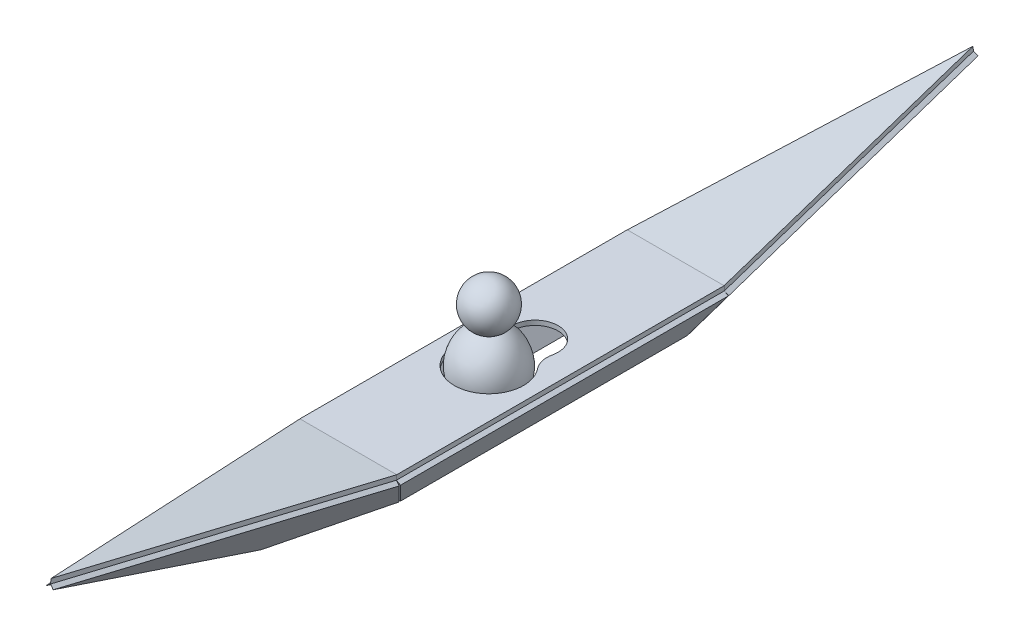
ISO-10303-21;
HEADER;
FILE_DESCRIPTION(('STEP AP214'),'2;1');
FILE_NAME('part.step','',(''),(''),'','','');
FILE_SCHEMA(('AUTOMOTIVE_DESIGN { 1 0 10303 214 1 1 1 1 }'));
ENDSEC;
DATA;
#1=APPLICATION_CONTEXT('core data for automotive mechanical design processes');
#2=APPLICATION_PROTOCOL_DEFINITION('international standard','automotive_design',2000,#1);
#3=PRODUCT_CONTEXT('',#1,'mechanical');
#4=PRODUCT('Part','Part','',(#3));
#5=PRODUCT_RELATED_PRODUCT_CATEGORY('part','',(#4));
#6=PRODUCT_DEFINITION_FORMATION('','',#4);
#7=PRODUCT_DEFINITION_CONTEXT('part definition',#1,'design');
#8=PRODUCT_DEFINITION('design','',#6,#7);
#9=PRODUCT_DEFINITION_SHAPE('','',#8);
#10=(LENGTH_UNIT() NAMED_UNIT(*) SI_UNIT(.MILLI.,.METRE.));
#11=(NAMED_UNIT(*) PLANE_ANGLE_UNIT() SI_UNIT($,.RADIAN.));
#12=(NAMED_UNIT(*) SI_UNIT($,.STERADIAN.) SOLID_ANGLE_UNIT());
#13=UNCERTAINTY_MEASURE_WITH_UNIT(LENGTH_MEASURE(1.E-05),#10,'distance_accuracy_value','');
#14=(GEOMETRIC_REPRESENTATION_CONTEXT(3) GLOBAL_UNCERTAINTY_ASSIGNED_CONTEXT((#13)) GLOBAL_UNIT_ASSIGNED_CONTEXT((#10,
#11,#12)) REPRESENTATION_CONTEXT('',''));
#15=CARTESIAN_POINT('',(0.,0.,0.));
#16=DIRECTION('',(0.,0.,1.));
#17=DIRECTION('',(1.,0.,0.));
#18=AXIS2_PLACEMENT_3D('',#15,#16,#17);
#19=CARTESIAN_POINT('',(0.,16.7332005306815,13.));
#20=DIRECTION('',(-1.,0.,0.));
#21=DIRECTION('',(0.,0.,-1.));
#22=AXIS2_PLACEMENT_3D('',#19,#20,#21);
#23=CIRCLE('',#22,17.);
#24=TRIMMED_CURVE('',#23,(PARAMETER_VALUE(-1.39339672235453)),
(PARAMETER_VALUE(1.39339672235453)),.T.,.PARAMETER.);
#25=CARTESIAN_POINT('',(0.,16.7332005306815,10.));
#26=DIRECTION('',(0.,-1.,0.));
#27=AXIS1_PLACEMENT('',#25,#26);
#28=SURFACE_OF_REVOLUTION('',#24,#27);
#29=CARTESIAN_POINT('',(0.,31.546054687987,10.));
#30=DIRECTION('',(0.,-1.,0.));
#31=DIRECTION('',(0.,0.,-1.));
#32=AXIS2_PLACEMENT_3D('',#29,#30,#31);
#33=CIRCLE('',#32,5.34142384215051);
#34=CARTESIAN_POINT('',(0.,31.546054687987,4.65857615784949));
#35=VERTEX_POINT('',#34);
#36=EDGE_CURVE('E13',#35,#35,#33,.T.);
#37=ORIENTED_EDGE('',*,*,#36,.T.);
#38=EDGE_LOOP('',(#37));
#39=FACE_BOUND('',#38,.T.);
#40=CARTESIAN_POINT('',(0.,0.,10.));
#41=VERTEX_POINT('',#40);
#42=VERTEX_LOOP('',#41);
#43=FACE_BOUND('',#42,.T.);
#44=ADVANCED_FACE('F63',(#39,#43),#28,.T.);
#45=CARTESIAN_POINT('',(0.,40.,10.));
#46=DIRECTION('',(0.,-1.,0.));
#47=DIRECTION('',(0.,0.,-1.));
#48=AXIS2_PLACEMENT_3D('',#45,#46,#47);
#49=SPHERICAL_SURFACE('',#48,10.);
#50=ORIENTED_EDGE('',*,*,#36,.F.);
#51=EDGE_LOOP('',(#50));
#52=FACE_BOUND('',#51,.T.);
#53=ADVANCED_FACE('F71',(#52),#49,.T.);
#54=CLOSED_SHELL('',(#44,#53));
#55=MANIFOLD_SOLID_BREP('B2_NOT_SHOWN',#54);
#56=CARTESIAN_POINT('',(-21.8807202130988,0.,197.522880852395));
#57=DIRECTION('',(-0.570781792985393,-0.80860754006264,-0.142695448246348));
#58=DIRECTION('',(0.242535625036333,0.,-0.970142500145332));
#59=AXIS2_PLACEMENT_3D('',#56,#57,#58);
#60=PLANE('',#59);
#61=DIRECTION('',(0.784464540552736,-0.588348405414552,0.196116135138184));
#62=VECTOR('',#61,1.);
#63=CARTESIAN_POINT('',(0.,0.,110.));
#64=LINE('',#63,#62);
#65=CARTESIAN_POINT('',(0.,0.,110.));
#66=VERTEX_POINT('',#65);
#67=CARTESIAN_POINT('',(1.56892908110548,-1.17669681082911,110.392232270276));
#68=VERTEX_POINT('',#67);
#69=EDGE_CURVE('E98',#66,#68,#64,.T.);
#70=ORIENTED_EDGE('',*,*,#69,.F.);
#71=DIRECTION('',(0.242535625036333,0.,-0.970142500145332));
#72=VECTOR('',#71,1.);
#73=CARTESIAN_POINT('',(-21.8807202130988,0.,197.522880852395));
#74=LINE('',#73,#72);
#75=CARTESIAN_POINT('',(11.9722436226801,0.,62.1110255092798));
#76=VERTEX_POINT('',#75);
#77=EDGE_CURVE('E209',#66,#76,#74,.T.);
#78=ORIENTED_EDGE('',*,*,#77,.T.);
#79=DIRECTION('',(0.784464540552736,-0.588348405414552,0.196116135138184));
#80=VECTOR('',#79,1.);
#81=CARTESIAN_POINT('',(11.9722436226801,0.,62.1110255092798));
#82=LINE('',#81,#80);
#83=CARTESIAN_POINT('',(13.5411727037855,-1.1766968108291,62.5032577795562));
#84=VERTEX_POINT('',#83);
#85=EDGE_CURVE('E164',#76,#84,#82,.T.);
#86=ORIENTED_EDGE('',*,*,#85,.T.);
#87=DIRECTION('',(0.242535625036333,0.,-0.970142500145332));
#88=VECTOR('',#87,1.);
#89=CARTESIAN_POINT('',(-20.3117911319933,-1.17669681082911,197.915113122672));
#90=LINE('',#89,#88);
#91=EDGE_CURVE('E219',#68,#84,#90,.T.);
#92=ORIENTED_EDGE('',*,*,#91,.F.);
#93=EDGE_LOOP('',(#70,#78,#86,#92));
#94=FACE_BOUND('',#93,.T.);
#95=ADVANCED_FACE('F154',(#94),#60,.T.);
#96=CARTESIAN_POINT('',(40.7544346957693,47.896461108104,90.6716445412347));
#97=DIRECTION('',(0.417446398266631,0.267072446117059,-0.868568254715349));
#98=DIRECTION('',(0.458643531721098,0.763228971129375,0.455112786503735));
#99=AXIS2_PLACEMENT_3D('',#96,#97,#98);
#100=PLANE('',#99);
#101=ORIENTED_EDGE('',*,*,#85,.F.);
#102=DIRECTION('',(0.458643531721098,0.763228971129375,0.455112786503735));
#103=VECTOR('',#102,1.);
#104=CARTESIAN_POINT('',(40.7544346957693,47.896461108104,90.6716445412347));
#105=LINE('',#104,#103);
#106=CARTESIAN_POINT('',(20.98612181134,15.,71.0555127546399));
#107=VERTEX_POINT('',#106);
#108=EDGE_CURVE('E204',#76,#107,#105,.T.);
#109=ORIENTED_EDGE('',*,*,#108,.T.);
#110=DIRECTION('',(0.784464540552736,-0.588348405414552,0.196116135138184));
#111=VECTOR('',#110,1.);
#112=CARTESIAN_POINT('',(20.98612181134,15.,71.0555127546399));
#113=LINE('',#112,#111);
#114=CARTESIAN_POINT('',(22.5550508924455,13.8233031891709,71.4477450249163));
#115=VERTEX_POINT('',#114);
#116=EDGE_CURVE('E172',#107,#115,#113,.T.);
#117=ORIENTED_EDGE('',*,*,#116,.T.);
#118=DIRECTION('',(0.458643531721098,0.763228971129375,0.455112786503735));
#119=VECTOR('',#118,1.);
#120=CARTESIAN_POINT('',(42.3233637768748,46.7197642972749,91.0638768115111));
#121=LINE('',#120,#119);
#122=EDGE_CURVE('E223',#84,#115,#121,.T.);
#123=ORIENTED_EDGE('',*,*,#122,.F.);
#124=EDGE_LOOP('',(#101,#109,#117,#123));
#125=FACE_BOUND('',#124,.T.);
#126=ADVANCED_FACE('F208',(#125),#100,.T.);
#127=CARTESIAN_POINT('',(31.8441807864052,7.23911468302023,4.34062090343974));
#128=DIRECTION('',(-0.599287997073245,-0.800521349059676,-0.00441205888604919));
#129=DIRECTION('',(0.159590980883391,-0.114068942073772,-0.98057074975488));
#130=AXIS2_PLACEMENT_3D('',#127,#128,#129);
#131=PLANE('',#130);
#132=ORIENTED_EDGE('',*,*,#116,.F.);
#133=DIRECTION('',(0.159590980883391,-0.114068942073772,-0.98057074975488));
#134=VECTOR('',#133,1.);
#135=CARTESIAN_POINT('',(31.8441807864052,7.23911468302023,4.34062090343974));
#136=LINE('',#135,#134);
#137=CARTESIAN_POINT('',(0.,30.,200.));
#138=VERTEX_POINT('',#137);
#139=EDGE_CURVE('E194',#138,#107,#136,.T.);
#140=ORIENTED_EDGE('',*,*,#139,.F.);
#141=DIRECTION('',(0.784464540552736,-0.588348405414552,0.196116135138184));
#142=VECTOR('',#141,1.);
#143=CARTESIAN_POINT('',(0.,30.,200.));
#144=LINE('',#143,#142);
#145=CARTESIAN_POINT('',(1.56892908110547,28.8233031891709,200.392232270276));
#146=VERTEX_POINT('',#145);
#147=EDGE_CURVE('E158',#138,#146,#144,.T.);
#148=ORIENTED_EDGE('',*,*,#147,.T.);
#149=DIRECTION('',(0.159590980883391,-0.114068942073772,-0.98057074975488));
#150=VECTOR('',#149,1.);
#151=CARTESIAN_POINT('',(33.4131098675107,6.06241787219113,4.73285317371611));
#152=LINE('',#151,#150);
#153=EDGE_CURVE('E196',#146,#115,#152,.T.);
#154=ORIENTED_EDGE('',*,*,#153,.T.);
#155=EDGE_LOOP('',(#132,#140,#148,#154));
#156=FACE_BOUND('',#155,.T.);
#157=ADVANCED_FACE('F193',(#156),#131,.F.);
#158=CARTESIAN_POINT('',(0.,-33.,11.));
#159=DIRECTION('',(-0.620173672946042,-0.744208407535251,0.248069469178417));
#160=DIRECTION('',(0.,-0.316227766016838,-0.948683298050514));
#161=AXIS2_PLACEMENT_3D('',#158,#159,#160);
#162=PLANE('',#161);
#163=DIRECTION('',(0.,-0.316227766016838,-0.948683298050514));
#164=VECTOR('',#163,1.);
#165=CARTESIAN_POINT('',(0.,-33.,11.));
#166=LINE('',#165,#164);
#167=EDGE_CURVE('E206',#138,#66,#166,.T.);
#168=ORIENTED_EDGE('',*,*,#167,.T.);
#169=ORIENTED_EDGE('',*,*,#69,.T.);
#170=DIRECTION('',(0.,-0.316227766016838,-0.948683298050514));
#171=VECTOR('',#170,1.);
#172=CARTESIAN_POINT('',(1.56892908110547,-34.1766968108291,11.3922322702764));
#173=LINE('',#172,#171);
#174=EDGE_CURVE('E211',#146,#68,#173,.T.);
#175=ORIENTED_EDGE('',*,*,#174,.F.);
#176=ORIENTED_EDGE('',*,*,#147,.F.);
#177=EDGE_LOOP('',(#168,#169,#175,#176));
#178=FACE_BOUND('',#177,.T.);
#179=ADVANCED_FACE('F156',(#178),#162,.T.);
#180=CARTESIAN_POINT('',(18.4920060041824,-13.8690045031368,4.62300150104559));
#181=DIRECTION('',(0.784464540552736,-0.588348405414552,0.196116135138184));
#182=DIRECTION('',(0.6,0.8,0.));
#183=AXIS2_PLACEMENT_3D('',#180,#181,#182);
#184=PLANE('',#183);
#185=ORIENTED_EDGE('',*,*,#153,.F.);
#186=ORIENTED_EDGE('',*,*,#174,.T.);
#187=ORIENTED_EDGE('',*,*,#91,.T.);
#188=ORIENTED_EDGE('',*,*,#122,.T.);
#189=EDGE_LOOP('',(#185,#186,#187,#188));
#190=FACE_BOUND('',#189,.T.);
#191=ADVANCED_FACE('F222',(#190),#184,.T.);
#192=CARTESIAN_POINT('',(16.9230769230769,-12.6923076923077,4.23076923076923));
#193=DIRECTION('',(0.784464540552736,-0.588348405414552,0.196116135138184));
#194=DIRECTION('',(0.6,0.8,0.));
#195=AXIS2_PLACEMENT_3D('',#192,#193,#194);
#196=PLANE('',#195);
#197=ORIENTED_EDGE('',*,*,#139,.T.);
#198=ORIENTED_EDGE('',*,*,#108,.F.);
#199=ORIENTED_EDGE('',*,*,#77,.F.);
#200=ORIENTED_EDGE('',*,*,#167,.F.);
#201=EDGE_LOOP('',(#197,#198,#199,#200));
#202=FACE_BOUND('',#201,.T.);
#203=ADVANCED_FACE('F202',(#202),#196,.F.);
#204=CLOSED_SHELL('',(#95,#126,#157,#179,#191,#203));
#205=MANIFOLD_SOLID_BREP('B55',#204);
#206=CARTESIAN_POINT('',(20.4722209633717,0.,191.888883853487));
#207=DIRECTION('',(0.570781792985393,-0.80860754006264,-0.142695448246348));
#208=DIRECTION('',(0.242535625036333,0.,0.970142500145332));
#209=AXIS2_PLACEMENT_3D('',#206,#207,#208);
#210=PLANE('',#209);
#211=DIRECTION('',(-0.784464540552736,-0.588348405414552,0.196116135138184));
#212=VECTOR('',#211,1.);
#213=CARTESIAN_POINT('',(-11.97224362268,0.,62.1110255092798));
#214=LINE('',#213,#212);
#215=CARTESIAN_POINT('',(-11.97224362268,0.,62.1110255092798));
#216=VERTEX_POINT('',#215);
#217=CARTESIAN_POINT('',(-13.5411727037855,-1.1766968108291,62.5032577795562));
#218=VERTEX_POINT('',#217);
#219=EDGE_CURVE('E152',#216,#218,#214,.T.);
#220=ORIENTED_EDGE('',*,*,#219,.F.);
#221=DIRECTION('',(0.242535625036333,0.,0.970142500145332));
#222=VECTOR('',#221,1.);
#223=CARTESIAN_POINT('',(20.4722209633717,0.,191.888883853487));
#224=LINE('',#223,#222);
#225=CARTESIAN_POINT('',(0.,0.,110.));
#226=VERTEX_POINT('',#225);
#227=EDGE_CURVE('E366',#216,#226,#224,.T.);
#228=ORIENTED_EDGE('',*,*,#227,.T.);
#229=DIRECTION('',(-0.784464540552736,-0.588348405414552,0.196116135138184));
#230=VECTOR('',#229,1.);
#231=CARTESIAN_POINT('',(0.,0.,110.));
#232=LINE('',#231,#230);
#233=CARTESIAN_POINT('',(-1.56892908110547,-1.17669681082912,110.392232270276));
#234=VERTEX_POINT('',#233);
#235=EDGE_CURVE('E321',#226,#234,#232,.T.);
#236=ORIENTED_EDGE('',*,*,#235,.T.);
#237=DIRECTION('',(0.242535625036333,0.,0.970142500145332));
#238=VECTOR('',#237,1.);
#239=CARTESIAN_POINT('',(18.9032918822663,-1.1766968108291,192.281116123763));
#240=LINE('',#239,#238);
#241=EDGE_CURVE('E376',#218,#234,#240,.T.);
#242=ORIENTED_EDGE('',*,*,#241,.F.);
#243=EDGE_LOOP('',(#220,#228,#236,#242));
#244=FACE_BOUND('',#243,.T.);
#245=ADVANCED_FACE('F311',(#244),#210,.T.);
#246=CARTESIAN_POINT('',(0.,-33.,11.));
#247=DIRECTION('',(-0.620173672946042,0.744208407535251,-0.248069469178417));
#248=DIRECTION('',(0.,-0.316227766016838,-0.948683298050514));
#249=AXIS2_PLACEMENT_3D('',#246,#247,#248);
#250=PLANE('',#249);
#251=ORIENTED_EDGE('',*,*,#235,.F.);
#252=DIRECTION('',(0.,-0.316227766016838,-0.948683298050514));
#253=VECTOR('',#252,1.);
#254=CARTESIAN_POINT('',(0.,-33.,11.));
#255=LINE('',#254,#253);
#256=CARTESIAN_POINT('',(0.,30.,200.));
#257=VERTEX_POINT('',#256);
#258=EDGE_CURVE('E361',#257,#226,#255,.T.);
#259=ORIENTED_EDGE('',*,*,#258,.F.);
#260=DIRECTION('',(-0.784464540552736,-0.588348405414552,0.196116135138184));
#261=VECTOR('',#260,1.);
#262=CARTESIAN_POINT('',(0.,30.,200.));
#263=LINE('',#262,#261);
#264=CARTESIAN_POINT('',(-1.56892908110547,28.8233031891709,200.392232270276));
#265=VERTEX_POINT('',#264);
#266=EDGE_CURVE('E329',#257,#265,#263,.T.);
#267=ORIENTED_EDGE('',*,*,#266,.T.);
#268=DIRECTION('',(0.,-0.316227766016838,-0.948683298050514));
#269=VECTOR('',#268,1.);
#270=CARTESIAN_POINT('',(-1.56892908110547,-34.1766968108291,11.3922322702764));
#271=LINE('',#270,#269);
#272=EDGE_CURVE('E380',#265,#234,#271,.T.);
#273=ORIENTED_EDGE('',*,*,#272,.T.);
#274=EDGE_LOOP('',(#251,#259,#267,#273));
#275=FACE_BOUND('',#274,.T.);
#276=ADVANCED_FACE('F365',(#275),#250,.F.);
#277=CARTESIAN_POINT('',(-31.8441807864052,7.23911468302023,4.34062090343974));
#278=DIRECTION('',(0.599287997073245,-0.800521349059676,-0.00441205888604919));
#279=DIRECTION('',(0.159590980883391,0.114068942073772,0.98057074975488));
#280=AXIS2_PLACEMENT_3D('',#277,#278,#279);
#281=PLANE('',#280);
#282=ORIENTED_EDGE('',*,*,#266,.F.);
#283=DIRECTION('',(0.159590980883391,0.114068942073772,0.98057074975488));
#284=VECTOR('',#283,1.);
#285=CARTESIAN_POINT('',(-31.8441807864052,7.23911468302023,4.34062090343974));
#286=LINE('',#285,#284);
#287=CARTESIAN_POINT('',(-20.98612181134,15.,71.0555127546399));
#288=VERTEX_POINT('',#287);
#289=EDGE_CURVE('E351',#288,#257,#286,.T.);
#290=ORIENTED_EDGE('',*,*,#289,.F.);
#291=DIRECTION('',(-0.784464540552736,-0.588348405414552,0.196116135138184));
#292=VECTOR('',#291,1.);
#293=CARTESIAN_POINT('',(-20.98612181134,15.,71.0555127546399));
#294=LINE('',#293,#292);
#295=CARTESIAN_POINT('',(-22.5550508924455,13.8233031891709,71.4477450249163));
#296=VERTEX_POINT('',#295);
#297=EDGE_CURVE('E315',#288,#296,#294,.T.);
#298=ORIENTED_EDGE('',*,*,#297,.T.);
#299=DIRECTION('',(0.159590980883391,0.114068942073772,0.98057074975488));
#300=VECTOR('',#299,1.);
#301=CARTESIAN_POINT('',(-33.4131098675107,6.06241787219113,4.73285317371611));
#302=LINE('',#301,#300);
#303=EDGE_CURVE('E353',#296,#265,#302,.T.);
#304=ORIENTED_EDGE('',*,*,#303,.T.);
#305=EDGE_LOOP('',(#282,#290,#298,#304));
#306=FACE_BOUND('',#305,.T.);
#307=ADVANCED_FACE('F350',(#306),#281,.F.);
#308=CARTESIAN_POINT('',(-55.0481442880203,71.6826316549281,104.855317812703));
#309=DIRECTION('',(-0.41744639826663,0.267072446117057,-0.86856825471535));
#310=DIRECTION('',(0.458643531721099,-0.763228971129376,-0.455112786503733));
#311=AXIS2_PLACEMENT_3D('',#308,#309,#310);
#312=PLANE('',#311);
#313=DIRECTION('',(0.458643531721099,-0.763228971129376,-0.455112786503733));
#314=VECTOR('',#313,1.);
#315=CARTESIAN_POINT('',(-55.0481442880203,71.6826316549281,104.855317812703));
#316=LINE('',#315,#314);
#317=EDGE_CURVE('E363',#288,#216,#316,.T.);
#318=ORIENTED_EDGE('',*,*,#317,.T.);
#319=ORIENTED_EDGE('',*,*,#219,.T.);
#320=DIRECTION('',(0.458643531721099,-0.763228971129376,-0.455112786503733));
#321=VECTOR('',#320,1.);
#322=CARTESIAN_POINT('',(-56.6170733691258,70.505934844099,105.247550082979));
#323=LINE('',#322,#321);
#324=EDGE_CURVE('E368',#296,#218,#323,.T.);
#325=ORIENTED_EDGE('',*,*,#324,.F.);
#326=ORIENTED_EDGE('',*,*,#297,.F.);
#327=EDGE_LOOP('',(#318,#319,#325,#326));
#328=FACE_BOUND('',#327,.T.);
#329=ADVANCED_FACE('F313',(#328),#312,.T.);
#330=CARTESIAN_POINT('',(-18.4920060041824,-13.8690045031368,4.62300150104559));
#331=DIRECTION('',(-0.784464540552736,-0.588348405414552,0.196116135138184));
#332=DIRECTION('',(-0.6,0.8,0.));
#333=AXIS2_PLACEMENT_3D('',#330,#331,#332);
#334=PLANE('',#333);
#335=ORIENTED_EDGE('',*,*,#303,.F.);
#336=ORIENTED_EDGE('',*,*,#324,.T.);
#337=ORIENTED_EDGE('',*,*,#241,.T.);
#338=ORIENTED_EDGE('',*,*,#272,.F.);
#339=EDGE_LOOP('',(#335,#336,#337,#338));
#340=FACE_BOUND('',#339,.T.);
#341=ADVANCED_FACE('F379',(#340),#334,.T.);
#342=CARTESIAN_POINT('',(-16.9230769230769,-12.6923076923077,4.23076923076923));
#343=DIRECTION('',(-0.784464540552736,-0.588348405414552,0.196116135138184));
#344=DIRECTION('',(-0.6,0.8,0.));
#345=AXIS2_PLACEMENT_3D('',#342,#343,#344);
#346=PLANE('',#345);
#347=ORIENTED_EDGE('',*,*,#289,.T.);
#348=ORIENTED_EDGE('',*,*,#258,.T.);
#349=ORIENTED_EDGE('',*,*,#227,.F.);
#350=ORIENTED_EDGE('',*,*,#317,.F.);
#351=EDGE_LOOP('',(#347,#348,#349,#350));
#352=FACE_BOUND('',#351,.T.);
#353=ADVANCED_FACE('F359',(#352),#346,.F.);
#354=CLOSED_SHELL('',(#245,#276,#307,#329,#341,#353));
#355=MANIFOLD_SOLID_BREP('B92',#354);
#356=CARTESIAN_POINT('',(-88.,15.,71.0555127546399));
#357=DIRECTION('',(0.,-0.115549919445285,-0.993301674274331));
#358=DIRECTION('',(1.,0.,0.));
#359=AXIS2_PLACEMENT_3D('',#356,#357,#358);
#360=PLANE('',#359);
#361=DIRECTION('',(0.,0.993301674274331,-0.115549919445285));
#362=VECTOR('',#361,1.);
#363=CARTESIAN_POINT('',(20.98612181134,15.,71.0555127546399));
#364=LINE('',#363,#362);
#365=CARTESIAN_POINT('',(20.98612181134,15.,71.0555127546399));
#366=VERTEX_POINT('',#365);
#367=CARTESIAN_POINT('',(20.9861218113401,16.9866033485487,70.8244129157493));
#368=VERTEX_POINT('',#367);
#369=EDGE_CURVE('E309',#366,#368,#364,.T.);
#370=ORIENTED_EDGE('',*,*,#369,.F.);
#371=DIRECTION('',(1.,0.,0.));
#372=VECTOR('',#371,1.);
#373=CARTESIAN_POINT('',(-88.,15.,71.0555127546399));
#374=LINE('',#373,#372);
#375=CARTESIAN_POINT('',(-20.98612181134,15.,71.0555127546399));
#376=VERTEX_POINT('',#375);
#377=EDGE_CURVE('E511',#376,#366,#374,.T.);
#378=ORIENTED_EDGE('',*,*,#377,.F.);
#379=DIRECTION('',(0.,0.993301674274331,-0.115549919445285));
#380=VECTOR('',#379,1.);
#381=CARTESIAN_POINT('',(-20.98612181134,15.,71.0555127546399));
#382=LINE('',#381,#380);
#383=CARTESIAN_POINT('',(-20.98612181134,16.9866033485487,70.8244129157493));
#384=VERTEX_POINT('',#383);
#385=EDGE_CURVE('E479',#376,#384,#382,.T.);
#386=ORIENTED_EDGE('',*,*,#385,.T.);
#387=DIRECTION('',(1.,0.,0.));
#388=VECTOR('',#387,1.);
#389=CARTESIAN_POINT('',(-88.,16.9866033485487,70.8244129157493));
#390=LINE('',#389,#388);
#391=EDGE_CURVE('E521',#384,#368,#390,.T.);
#392=ORIENTED_EDGE('',*,*,#391,.T.);
#393=EDGE_LOOP('',(#370,#378,#386,#392));
#394=FACE_BOUND('',#393,.T.);
#395=ADVANCED_FACE('F469',(#394),#360,.T.);
#396=CARTESIAN_POINT('',(-31.8441807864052,7.23911468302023,4.34062090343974));
#397=DIRECTION('',(0.987183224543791,-0.0184407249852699,-0.158521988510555));
#398=DIRECTION('',(0.159590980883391,0.114068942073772,0.98057074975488));
#399=AXIS2_PLACEMENT_3D('',#396,#397,#398);
#400=PLANE('',#399);
#401=ORIENTED_EDGE('',*,*,#385,.F.);
#402=DIRECTION('',(0.159590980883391,0.114068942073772,0.98057074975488));
#403=VECTOR('',#402,1.);
#404=CARTESIAN_POINT('',(-31.8441807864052,7.23911468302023,4.34062090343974));
#405=LINE('',#404,#403);
#406=CARTESIAN_POINT('',(0.,30.,200.));
#407=VERTEX_POINT('',#406);
#408=EDGE_CURVE('E502',#376,#407,#405,.T.);
#409=ORIENTED_EDGE('',*,*,#408,.T.);
#410=DIRECTION('',(0.,0.993301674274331,-0.115549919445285));
#411=VECTOR('',#410,1.);
#412=CARTESIAN_POINT('',(0.,30.,200.));
#413=LINE('',#412,#411);
#414=CARTESIAN_POINT('',(0.,31.9866033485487,199.768900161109));
#415=VERTEX_POINT('',#414);
#416=EDGE_CURVE('E473',#407,#415,#413,.T.);
#417=ORIENTED_EDGE('',*,*,#416,.T.);
#418=DIRECTION('',(0.159590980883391,0.114068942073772,0.98057074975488));
#419=VECTOR('',#418,1.);
#420=CARTESIAN_POINT('',(-31.8441807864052,9.22571803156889,4.10952106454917));
#421=LINE('',#420,#419);
#422=EDGE_CURVE('E504',#384,#415,#421,.T.);
#423=ORIENTED_EDGE('',*,*,#422,.F.);
#424=EDGE_LOOP('',(#401,#409,#417,#423));
#425=FACE_BOUND('',#424,.T.);
#426=ADVANCED_FACE('F501',(#425),#400,.F.);
#427=CARTESIAN_POINT('',(31.8441807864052,7.23911468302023,4.34062090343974));
#428=DIRECTION('',(-0.987183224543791,-0.0184407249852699,-0.158521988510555));
#429=DIRECTION('',(0.159590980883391,-0.114068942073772,-0.98057074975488));
#430=AXIS2_PLACEMENT_3D('',#427,#428,#429);
#431=PLANE('',#430);
#432=DIRECTION('',(0.159590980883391,-0.114068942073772,-0.98057074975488));
#433=VECTOR('',#432,1.);
#434=CARTESIAN_POINT('',(31.8441807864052,7.23911468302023,4.34062090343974));
#435=LINE('',#434,#433);
#436=EDGE_CURVE('E512',#407,#366,#435,.T.);
#437=ORIENTED_EDGE('',*,*,#436,.T.);
#438=ORIENTED_EDGE('',*,*,#369,.T.);
#439=DIRECTION('',(0.159590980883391,-0.114068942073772,-0.98057074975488));
#440=VECTOR('',#439,1.);
#441=CARTESIAN_POINT('',(31.8441807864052,9.22571803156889,4.10952106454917));
#442=LINE('',#441,#440);
#443=EDGE_CURVE('E515',#415,#368,#442,.T.);
#444=ORIENTED_EDGE('',*,*,#443,.F.);
#445=ORIENTED_EDGE('',*,*,#416,.F.);
#446=EDGE_LOOP('',(#437,#438,#444,#445));
#447=FACE_BOUND('',#446,.T.);
#448=ADVANCED_FACE('F471',(#447),#431,.F.);
#449=CARTESIAN_POINT('',(-88.,31.9866033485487,199.768900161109));
#450=DIRECTION('',(0.,-0.993301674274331,0.115549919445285));
#451=DIRECTION('',(0.,-0.115549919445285,-0.993301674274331));
#452=AXIS2_PLACEMENT_3D('',#449,#450,#451);
#453=PLANE('',#452);
#454=ORIENTED_EDGE('',*,*,#422,.T.);
#455=ORIENTED_EDGE('',*,*,#443,.T.);
#456=ORIENTED_EDGE('',*,*,#391,.F.);
#457=EDGE_LOOP('',(#454,#455,#456));
#458=FACE_BOUND('',#457,.T.);
#459=ADVANCED_FACE('F525',(#458),#453,.F.);
#460=CARTESIAN_POINT('',(-88.,30.,200.));
#461=DIRECTION('',(0.,-0.993301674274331,0.115549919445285));
#462=DIRECTION('',(0.,-0.115549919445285,-0.993301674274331));
#463=AXIS2_PLACEMENT_3D('',#460,#461,#462);
#464=PLANE('',#463);
#465=ORIENTED_EDGE('',*,*,#408,.F.);
#466=ORIENTED_EDGE('',*,*,#377,.T.);
#467=ORIENTED_EDGE('',*,*,#436,.F.);
#468=EDGE_LOOP('',(#465,#466,#467));
#469=FACE_BOUND('',#468,.T.);
#470=ADVANCED_FACE('F510',(#469),#464,.T.);
#471=CLOSED_SHELL('',(#395,#426,#448,#459,#470));
#472=MANIFOLD_SOLID_BREP('B146',#471);
#473=CARTESIAN_POINT('',(-55.0481442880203,71.6826316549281,-104.855317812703));
#474=DIRECTION('',(-0.234418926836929,0.390096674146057,0.890433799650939));
#475=DIRECTION('',(0.458643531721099,-0.763228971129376,0.455112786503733));
#476=AXIS2_PLACEMENT_3D('',#473,#474,#475);
#477=PLANE('',#476);
#478=DIRECTION('',(-0.857142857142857,-0.515078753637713,0.));
#479=VECTOR('',#478,1.);
#480=CARTESIAN_POINT('',(-20.98612181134,15.,-71.0555127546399));
#481=LINE('',#480,#479);
#482=CARTESIAN_POINT('',(-20.98612181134,15.,-71.0555127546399));
#483=VERTEX_POINT('',#482);
#484=CARTESIAN_POINT('',(-22.7004075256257,13.9698424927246,-71.0555127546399));
#485=VERTEX_POINT('',#484);
#486=EDGE_CURVE('E467',#483,#485,#481,.T.);
#487=ORIENTED_EDGE('',*,*,#486,.F.);
#488=DIRECTION('',(0.458643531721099,-0.763228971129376,0.455112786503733));
#489=VECTOR('',#488,1.);
#490=CARTESIAN_POINT('',(-55.0481442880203,71.6826316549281,-104.855317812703));
#491=LINE('',#490,#489);
#492=CARTESIAN_POINT('',(-11.97224362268,0.,-62.1110255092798));
#493=VERTEX_POINT('',#492);
#494=EDGE_CURVE('E659',#483,#493,#491,.T.);
#495=ORIENTED_EDGE('',*,*,#494,.T.);
#496=DIRECTION('',(-0.857142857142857,-0.515078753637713,0.));
#497=VECTOR('',#496,1.);
#498=CARTESIAN_POINT('',(-11.97224362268,0.,-62.1110255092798));
#499=LINE('',#498,#497);
#500=CARTESIAN_POINT('',(-13.6865293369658,-1.03015750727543,-62.1110255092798));
#501=VERTEX_POINT('',#500);
#502=EDGE_CURVE('E609',#493,#501,#499,.T.);
#503=ORIENTED_EDGE('',*,*,#502,.T.);
#504=DIRECTION('',(0.458643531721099,-0.763228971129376,0.455112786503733));
#505=VECTOR('',#504,1.);
#506=CARTESIAN_POINT('',(-56.762430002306,70.6524741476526,-104.855317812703));
#507=LINE('',#506,#505);
#508=EDGE_CURVE('E674',#485,#501,#507,.T.);
#509=ORIENTED_EDGE('',*,*,#508,.F.);
#510=EDGE_LOOP('',(#487,#495,#503,#509));
#511=FACE_BOUND('',#510,.T.);
#512=ADVANCED_FACE('F598',(#511),#477,.F.);
#513=CARTESIAN_POINT('',(-11.97224362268,0.,200.));
#514=DIRECTION('',(0.515078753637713,-0.857142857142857,0.));
#515=DIRECTION('',(0.,0.,-1.));
#516=AXIS2_PLACEMENT_3D('',#513,#514,#515);
#517=PLANE('',#516);
#518=ORIENTED_EDGE('',*,*,#502,.F.);
#519=DIRECTION('',(0.,0.,-1.));
#520=VECTOR('',#519,1.);
#521=CARTESIAN_POINT('',(-11.97224362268,0.,200.));
#522=LINE('',#521,#520);
#523=CARTESIAN_POINT('',(-11.97224362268,0.,62.1110255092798));
#524=VERTEX_POINT('',#523);
#525=EDGE_CURVE('E653',#524,#493,#522,.T.);
#526=ORIENTED_EDGE('',*,*,#525,.F.);
#527=DIRECTION('',(-0.857142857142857,-0.515078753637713,0.));
#528=VECTOR('',#527,1.);
#529=CARTESIAN_POINT('',(-11.97224362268,0.,62.1110255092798));
#530=LINE('',#529,#528);
#531=CARTESIAN_POINT('',(-13.6865293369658,-1.03015750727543,62.1110255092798));
#532=VERTEX_POINT('',#531);
#533=EDGE_CURVE('E617',#524,#532,#530,.T.);
#534=ORIENTED_EDGE('',*,*,#533,.T.);
#535=DIRECTION('',(0.,0.,1.));
#536=VECTOR('',#535,1.);
#537=CARTESIAN_POINT('',(-13.6865293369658,-1.03015750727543,200.));
#538=LINE('',#537,#536);
#539=EDGE_CURVE('E678',#532,#501,#538,.F.);
#540=ORIENTED_EDGE('',*,*,#539,.T.);
#541=EDGE_LOOP('',(#518,#526,#534,#540));
#542=FACE_BOUND('',#541,.T.);
#543=ADVANCED_FACE('F657',(#542),#517,.T.);
#544=CARTESIAN_POINT('',(-55.0481442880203,71.6826316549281,104.855317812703));
#545=DIRECTION('',(0.234418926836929,-0.390096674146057,0.890433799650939));
#546=DIRECTION('',(0.458643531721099,-0.763228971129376,-0.455112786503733));
#547=AXIS2_PLACEMENT_3D('',#544,#545,#546);
#548=PLANE('',#547);
#549=ORIENTED_EDGE('',*,*,#533,.F.);
#550=DIRECTION('',(0.458643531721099,-0.763228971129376,-0.455112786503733));
#551=VECTOR('',#550,1.);
#552=CARTESIAN_POINT('',(-55.0481442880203,71.6826316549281,104.855317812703));
#553=LINE('',#552,#551);
#554=CARTESIAN_POINT('',(-20.98612181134,15.,71.0555127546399));
#555=VERTEX_POINT('',#554);
#556=EDGE_CURVE('E643',#555,#524,#553,.T.);
#557=ORIENTED_EDGE('',*,*,#556,.F.);
#558=DIRECTION('',(-0.857142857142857,-0.515078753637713,0.));
#559=VECTOR('',#558,1.);
#560=CARTESIAN_POINT('',(-20.98612181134,15.,71.0555127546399));
#561=LINE('',#560,#559);
#562=CARTESIAN_POINT('',(-22.7004075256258,13.9698424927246,71.0555127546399));
#563=VERTEX_POINT('',#562);
#564=EDGE_CURVE('E602',#555,#563,#561,.T.);
#565=ORIENTED_EDGE('',*,*,#564,.T.);
#566=DIRECTION('',(0.458643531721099,-0.763228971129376,-0.455112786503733));
#567=VECTOR('',#566,1.);
#568=CARTESIAN_POINT('',(-56.762430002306,70.6524741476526,104.855317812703));
#569=LINE('',#568,#567);
#570=EDGE_CURVE('E645',#563,#532,#569,.T.);
#571=ORIENTED_EDGE('',*,*,#570,.T.);
#572=EDGE_LOOP('',(#549,#557,#565,#571));
#573=FACE_BOUND('',#572,.T.);
#574=ADVANCED_FACE('F642',(#573),#548,.T.);
#575=CARTESIAN_POINT('',(-20.98612181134,15.,200.));
#576=DIRECTION('',(0.515078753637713,-0.857142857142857,0.));
#577=DIRECTION('',(0.,0.,-1.));
#578=AXIS2_PLACEMENT_3D('',#575,#576,#577);
#579=PLANE('',#578);
#580=DIRECTION('',(0.,0.,-1.));
#581=VECTOR('',#580,1.);
#582=CARTESIAN_POINT('',(-20.98612181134,15.,200.));
#583=LINE('',#582,#581);
#584=EDGE_CURVE('E655',#555,#483,#583,.T.);
#585=ORIENTED_EDGE('',*,*,#584,.T.);
#586=ORIENTED_EDGE('',*,*,#486,.T.);
#587=DIRECTION('',(0.,0.,1.));
#588=VECTOR('',#587,1.);
#589=CARTESIAN_POINT('',(-22.7004075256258,13.9698424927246,200.));
#590=LINE('',#589,#588);
#591=EDGE_CURVE('E663',#563,#485,#590,.F.);
#592=ORIENTED_EDGE('',*,*,#591,.F.);
#593=ORIENTED_EDGE('',*,*,#564,.F.);
#594=EDGE_LOOP('',(#585,#586,#592,#593));
#595=FACE_BOUND('',#594,.T.);
#596=ADVANCED_FACE('F600',(#595),#579,.F.);
#597=CARTESIAN_POINT('',(-31.7142857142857,28.9698424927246,200.));
#598=DIRECTION('',(0.857142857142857,0.515078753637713,0.));
#599=DIRECTION('',(-0.515078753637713,0.857142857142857,0.));
#600=AXIS2_PLACEMENT_3D('',#597,#598,#599);
#601=PLANE('',#600);
#602=ORIENTED_EDGE('',*,*,#570,.F.);
#603=ORIENTED_EDGE('',*,*,#591,.T.);
#604=ORIENTED_EDGE('',*,*,#508,.T.);
#605=ORIENTED_EDGE('',*,*,#539,.F.);
#606=EDGE_LOOP('',(#602,#603,#604,#605));
#607=FACE_BOUND('',#606,.T.);
#608=ADVANCED_FACE('F677',(#607),#601,.F.);
#609=CARTESIAN_POINT('',(-30.,30.,200.));
#610=DIRECTION('',(0.857142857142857,0.515078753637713,0.));
#611=DIRECTION('',(-0.515078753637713,0.857142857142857,0.));
#612=AXIS2_PLACEMENT_3D('',#609,#610,#611);
#613=PLANE('',#612);
#614=ORIENTED_EDGE('',*,*,#556,.T.);
#615=ORIENTED_EDGE('',*,*,#525,.T.);
#616=ORIENTED_EDGE('',*,*,#494,.F.);
#617=ORIENTED_EDGE('',*,*,#584,.F.);
#618=EDGE_LOOP('',(#614,#615,#616,#617));
#619=FACE_BOUND('',#618,.T.);
#620=ADVANCED_FACE('F651',(#619),#613,.T.);
#621=CLOSED_SHELL('',(#512,#543,#574,#596,#608,#620));
#622=MANIFOLD_SOLID_BREP('B303',#621);
#623=CARTESIAN_POINT('',(20.4722209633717,0.,-191.888883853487));
#624=DIRECTION('',(-0.570781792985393,0.80860754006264,-0.142695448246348));
#625=DIRECTION('',(0.242535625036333,0.,-0.970142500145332));
#626=AXIS2_PLACEMENT_3D('',#623,#624,#625);
#627=PLANE('',#626);
#628=DIRECTION('',(-0.784464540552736,-0.588348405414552,-0.196116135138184));
#629=VECTOR('',#628,1.);
#630=CARTESIAN_POINT('',(0.,0.,-110.));
#631=LINE('',#630,#629);
#632=CARTESIAN_POINT('',(0.,0.,-110.));
#633=VERTEX_POINT('',#632);
#634=CARTESIAN_POINT('',(-1.56892908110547,-1.17669681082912,-110.392232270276));
#635=VERTEX_POINT('',#634);
#636=EDGE_CURVE('E596',#633,#635,#631,.T.);
#637=ORIENTED_EDGE('',*,*,#636,.F.);
#638=DIRECTION('',(0.242535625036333,0.,-0.970142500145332));
#639=VECTOR('',#638,1.);
#640=CARTESIAN_POINT('',(20.4722209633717,0.,-191.888883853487));
#641=LINE('',#640,#639);
#642=CARTESIAN_POINT('',(-11.97224362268,0.,-62.1110255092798));
#643=VERTEX_POINT('',#642);
#644=EDGE_CURVE('E839',#643,#633,#641,.T.);
#645=ORIENTED_EDGE('',*,*,#644,.F.);
#646=DIRECTION('',(-0.784464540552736,-0.588348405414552,-0.196116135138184));
#647=VECTOR('',#646,1.);
#648=CARTESIAN_POINT('',(-11.97224362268,0.,-62.1110255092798));
#649=LINE('',#648,#647);
#650=CARTESIAN_POINT('',(-13.5411727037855,-1.1766968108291,-62.5032577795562));
#651=VERTEX_POINT('',#650);
#652=EDGE_CURVE('E785',#643,#651,#649,.T.);
#653=ORIENTED_EDGE('',*,*,#652,.T.);
#654=DIRECTION('',(0.242535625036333,0.,-0.970142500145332));
#655=VECTOR('',#654,1.);
#656=CARTESIAN_POINT('',(18.9032918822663,-1.1766968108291,-192.281116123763));
#657=LINE('',#656,#655);
#658=EDGE_CURVE('E853',#651,#635,#657,.T.);
#659=ORIENTED_EDGE('',*,*,#658,.T.);
#660=EDGE_LOOP('',(#637,#645,#653,#659));
#661=FACE_BOUND('',#660,.T.);
#662=ADVANCED_FACE('F774',(#661),#627,.F.);
#663=CARTESIAN_POINT('',(-55.0481442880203,71.6826316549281,-104.855317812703));
#664=DIRECTION('',(0.41744639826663,-0.267072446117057,-0.86856825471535));
#665=DIRECTION('',(0.458643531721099,-0.763228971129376,0.455112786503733));
#666=AXIS2_PLACEMENT_3D('',#663,#664,#665);
#667=PLANE('',#666);
#668=ORIENTED_EDGE('',*,*,#652,.F.);
#669=DIRECTION('',(0.458643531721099,-0.763228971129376,0.455112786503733));
#670=VECTOR('',#669,1.);
#671=CARTESIAN_POINT('',(-55.0481442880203,71.6826316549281,-104.855317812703));
#672=LINE('',#671,#670);
#673=CARTESIAN_POINT('',(-20.98612181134,15.,-71.0555127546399));
#674=VERTEX_POINT('',#673);
#675=EDGE_CURVE('E832',#674,#643,#672,.T.);
#676=ORIENTED_EDGE('',*,*,#675,.F.);
#677=DIRECTION('',(-0.784464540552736,-0.588348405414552,-0.196116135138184));
#678=VECTOR('',#677,1.);
#679=CARTESIAN_POINT('',(-20.98612181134,15.,-71.0555127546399));
#680=LINE('',#679,#678);
#681=CARTESIAN_POINT('',(-22.5550508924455,13.8233031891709,-71.4477450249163));
#682=VERTEX_POINT('',#681);
#683=EDGE_CURVE('E796',#674,#682,#680,.T.);
#684=ORIENTED_EDGE('',*,*,#683,.T.);
#685=DIRECTION('',(0.458643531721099,-0.763228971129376,0.455112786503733));
#686=VECTOR('',#685,1.);
#687=CARTESIAN_POINT('',(-56.6170733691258,70.505934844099,-105.247550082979));
#688=LINE('',#687,#686);
#689=EDGE_CURVE('E857',#682,#651,#688,.T.);
#690=ORIENTED_EDGE('',*,*,#689,.T.);
#691=EDGE_LOOP('',(#668,#676,#684,#690));
#692=FACE_BOUND('',#691,.T.);
#693=ADVANCED_FACE('F837',(#692),#667,.F.);
#694=CARTESIAN_POINT('',(-31.8441807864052,7.23911468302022,-4.34062090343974));
#695=DIRECTION('',(0.599287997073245,-0.800521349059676,0.00441205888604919));
#696=DIRECTION('',(-0.159590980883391,-0.114068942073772,0.98057074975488));
#697=AXIS2_PLACEMENT_3D('',#694,#695,#696);
#698=PLANE('',#697);
#699=ORIENTED_EDGE('',*,*,#683,.F.);
#700=DIRECTION('',(-0.159590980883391,-0.114068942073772,0.98057074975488));
#701=VECTOR('',#700,1.);
#702=CARTESIAN_POINT('',(-31.8441807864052,7.23911468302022,-4.34062090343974));
#703=LINE('',#702,#701);
#704=CARTESIAN_POINT('',(0.,30.,-200.));
#705=VERTEX_POINT('',#704);
#706=EDGE_CURVE('E821',#705,#674,#703,.T.);
#707=ORIENTED_EDGE('',*,*,#706,.F.);
#708=DIRECTION('',(-0.784464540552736,-0.588348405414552,-0.196116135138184));
#709=VECTOR('',#708,1.);
#710=CARTESIAN_POINT('',(0.,30.,-200.));
#711=LINE('',#710,#709);
#712=CARTESIAN_POINT('',(-1.56892908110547,28.8233031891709,-200.392232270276));
#713=VERTEX_POINT('',#712);
#714=EDGE_CURVE('E778',#705,#713,#711,.T.);
#715=ORIENTED_EDGE('',*,*,#714,.T.);
#716=DIRECTION('',(-0.159590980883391,-0.114068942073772,0.98057074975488));
#717=VECTOR('',#716,1.);
#718=CARTESIAN_POINT('',(-33.4131098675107,6.06241787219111,-4.73285317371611));
#719=LINE('',#718,#717);
#720=EDGE_CURVE('E823',#713,#682,#719,.T.);
#721=ORIENTED_EDGE('',*,*,#720,.T.);
#722=EDGE_LOOP('',(#699,#707,#715,#721));
#723=FACE_BOUND('',#722,.T.);
#724=ADVANCED_FACE('F820',(#723),#698,.F.);
#725=CARTESIAN_POINT('',(0.,-33.,-11.));
#726=DIRECTION('',(0.620173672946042,-0.744208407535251,-0.248069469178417));
#727=DIRECTION('',(0.,-0.316227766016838,0.948683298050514));
#728=AXIS2_PLACEMENT_3D('',#725,#726,#727);
#729=PLANE('',#728);
#730=DIRECTION('',(0.,-0.316227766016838,0.948683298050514));
#731=VECTOR('',#730,1.);
#732=CARTESIAN_POINT('',(0.,-33.,-11.));
#733=LINE('',#732,#731);
#734=EDGE_CURVE('E834',#705,#633,#733,.T.);
#735=ORIENTED_EDGE('',*,*,#734,.T.);
#736=ORIENTED_EDGE('',*,*,#636,.T.);
#737=DIRECTION('',(0.,-0.316227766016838,0.948683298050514));
#738=VECTOR('',#737,1.);
#739=CARTESIAN_POINT('',(-1.56892908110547,-34.1766968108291,-11.3922322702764));
#740=LINE('',#739,#738);
#741=EDGE_CURVE('E844',#713,#635,#740,.T.);
#742=ORIENTED_EDGE('',*,*,#741,.F.);
#743=ORIENTED_EDGE('',*,*,#714,.F.);
#744=EDGE_LOOP('',(#735,#736,#742,#743));
#745=FACE_BOUND('',#744,.T.);
#746=ADVANCED_FACE('F776',(#745),#729,.T.);
#747=CARTESIAN_POINT('',(-18.4920060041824,-13.8690045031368,-4.62300150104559));
#748=DIRECTION('',(-0.784464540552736,-0.588348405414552,-0.196116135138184));
#749=DIRECTION('',(-0.6,0.8,0.));
#750=AXIS2_PLACEMENT_3D('',#747,#748,#749);
#751=PLANE('',#750);
#752=ORIENTED_EDGE('',*,*,#720,.F.);
#753=ORIENTED_EDGE('',*,*,#741,.T.);
#754=ORIENTED_EDGE('',*,*,#658,.F.);
#755=ORIENTED_EDGE('',*,*,#689,.F.);
#756=EDGE_LOOP('',(#752,#753,#754,#755));
#757=FACE_BOUND('',#756,.T.);
#758=ADVANCED_FACE('F856',(#757),#751,.T.);
#759=CARTESIAN_POINT('',(-16.9230769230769,-12.6923076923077,-4.23076923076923));
#760=DIRECTION('',(-0.784464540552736,-0.588348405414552,-0.196116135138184));
#761=DIRECTION('',(-0.6,0.8,0.));
#762=AXIS2_PLACEMENT_3D('',#759,#760,#761);
#763=PLANE('',#762);
#764=ORIENTED_EDGE('',*,*,#706,.T.);
#765=ORIENTED_EDGE('',*,*,#675,.T.);
#766=ORIENTED_EDGE('',*,*,#644,.T.);
#767=ORIENTED_EDGE('',*,*,#734,.F.);
#768=EDGE_LOOP('',(#764,#765,#766,#767));
#769=FACE_BOUND('',#768,.T.);
#770=ADVANCED_FACE('F830',(#769),#763,.F.);
#771=CLOSED_SHELL('',(#662,#693,#724,#746,#758,#770));
#772=MANIFOLD_SOLID_BREP('B461',#771);
#773=CARTESIAN_POINT('',(-21.8807202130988,0.,-197.522880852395));
#774=DIRECTION('',(0.570781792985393,0.80860754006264,-0.142695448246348));
#775=DIRECTION('',(0.242535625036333,0.,0.970142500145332));
#776=AXIS2_PLACEMENT_3D('',#773,#774,#775);
#777=PLANE('',#776);
#778=DIRECTION('',(0.784464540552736,-0.588348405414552,-0.196116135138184));
#779=VECTOR('',#778,1.);
#780=CARTESIAN_POINT('',(11.9722436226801,0.,-62.1110255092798));
#781=LINE('',#780,#779);
#782=CARTESIAN_POINT('',(11.9722436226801,0.,-62.1110255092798));
#783=VERTEX_POINT('',#782);
#784=CARTESIAN_POINT('',(13.5411727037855,-1.1766968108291,-62.5032577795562));
#785=VERTEX_POINT('',#784);
#786=EDGE_CURVE('E772',#783,#785,#781,.T.);
#787=ORIENTED_EDGE('',*,*,#786,.F.);
#788=DIRECTION('',(0.242535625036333,0.,0.970142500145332));
#789=VECTOR('',#788,1.);
#790=CARTESIAN_POINT('',(-21.8807202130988,0.,-197.522880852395));
#791=LINE('',#790,#789);
#792=CARTESIAN_POINT('',(0.,0.,-110.));
#793=VERTEX_POINT('',#792);
#794=EDGE_CURVE('E1021',#793,#783,#791,.T.);
#795=ORIENTED_EDGE('',*,*,#794,.F.);
#796=DIRECTION('',(0.784464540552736,-0.588348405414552,-0.196116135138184));
#797=VECTOR('',#796,1.);
#798=CARTESIAN_POINT('',(0.,0.,-110.));
#799=LINE('',#798,#797);
#800=CARTESIAN_POINT('',(1.56892908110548,-1.17669681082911,-110.392232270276));
#801=VERTEX_POINT('',#800);
#802=EDGE_CURVE('E968',#793,#801,#799,.T.);
#803=ORIENTED_EDGE('',*,*,#802,.T.);
#804=DIRECTION('',(0.242535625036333,0.,0.970142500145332));
#805=VECTOR('',#804,1.);
#806=CARTESIAN_POINT('',(-20.3117911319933,-1.17669681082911,-197.915113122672));
#807=LINE('',#806,#805);
#808=EDGE_CURVE('E1036',#801,#785,#807,.T.);
#809=ORIENTED_EDGE('',*,*,#808,.T.);
#810=EDGE_LOOP('',(#787,#795,#803,#809));
#811=FACE_BOUND('',#810,.T.);
#812=ADVANCED_FACE('F957',(#811),#777,.F.);
#813=CARTESIAN_POINT('',(0.,-33.,-11.));
#814=DIRECTION('',(0.620173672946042,0.744208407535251,0.248069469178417));
#815=DIRECTION('',(0.,-0.316227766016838,0.948683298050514));
#816=AXIS2_PLACEMENT_3D('',#813,#814,#815);
#817=PLANE('',#816);
#818=ORIENTED_EDGE('',*,*,#802,.F.);
#819=DIRECTION('',(0.,-0.316227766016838,0.948683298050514));
#820=VECTOR('',#819,1.);
#821=CARTESIAN_POINT('',(0.,-33.,-11.));
#822=LINE('',#821,#820);
#823=CARTESIAN_POINT('',(0.,30.,-200.));
#824=VERTEX_POINT('',#823);
#825=EDGE_CURVE('E1014',#824,#793,#822,.T.);
#826=ORIENTED_EDGE('',*,*,#825,.F.);
#827=DIRECTION('',(0.784464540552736,-0.588348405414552,-0.196116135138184));
#828=VECTOR('',#827,1.);
#829=CARTESIAN_POINT('',(0.,30.,-200.));
#830=LINE('',#829,#828);
#831=CARTESIAN_POINT('',(1.56892908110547,28.8233031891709,-200.392232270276));
#832=VERTEX_POINT('',#831);
#833=EDGE_CURVE('E976',#824,#832,#830,.T.);
#834=ORIENTED_EDGE('',*,*,#833,.T.);
#835=DIRECTION('',(0.,-0.316227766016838,0.948683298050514));
#836=VECTOR('',#835,1.);
#837=CARTESIAN_POINT('',(1.56892908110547,-34.1766968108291,-11.3922322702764));
#838=LINE('',#837,#836);
#839=EDGE_CURVE('E1040',#832,#801,#838,.T.);
#840=ORIENTED_EDGE('',*,*,#839,.T.);
#841=EDGE_LOOP('',(#818,#826,#834,#840));
#842=FACE_BOUND('',#841,.T.);
#843=ADVANCED_FACE('F1019',(#842),#817,.F.);
#844=CARTESIAN_POINT('',(31.8441807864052,7.23911468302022,-4.34062090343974));
#845=DIRECTION('',(-0.599287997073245,-0.800521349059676,0.00441205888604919));
#846=DIRECTION('',(-0.159590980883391,0.114068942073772,-0.98057074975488));
#847=AXIS2_PLACEMENT_3D('',#844,#845,#846);
#848=PLANE('',#847);
#849=ORIENTED_EDGE('',*,*,#833,.F.);
#850=DIRECTION('',(-0.159590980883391,0.114068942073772,-0.98057074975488));
#851=VECTOR('',#850,1.);
#852=CARTESIAN_POINT('',(31.8441807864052,7.23911468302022,-4.34062090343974));
#853=LINE('',#852,#851);
#854=CARTESIAN_POINT('',(20.98612181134,15.,-71.0555127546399));
#855=VERTEX_POINT('',#854);
#856=EDGE_CURVE('E1004',#855,#824,#853,.T.);
#857=ORIENTED_EDGE('',*,*,#856,.F.);
#858=DIRECTION('',(0.784464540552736,-0.588348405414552,-0.196116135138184));
#859=VECTOR('',#858,1.);
#860=CARTESIAN_POINT('',(20.98612181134,15.,-71.0555127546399));
#861=LINE('',#860,#859);
#862=CARTESIAN_POINT('',(22.5550508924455,13.8233031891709,-71.4477450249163));
#863=VERTEX_POINT('',#862);
#864=EDGE_CURVE('E961',#855,#863,#861,.T.);
#865=ORIENTED_EDGE('',*,*,#864,.T.);
#866=DIRECTION('',(-0.159590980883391,0.114068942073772,-0.98057074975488));
#867=VECTOR('',#866,1.);
#868=CARTESIAN_POINT('',(33.4131098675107,6.06241787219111,-4.73285317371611));
#869=LINE('',#868,#867);
#870=EDGE_CURVE('E1006',#863,#832,#869,.T.);
#871=ORIENTED_EDGE('',*,*,#870,.T.);
#872=EDGE_LOOP('',(#849,#857,#865,#871));
#873=FACE_BOUND('',#872,.T.);
#874=ADVANCED_FACE('F1003',(#873),#848,.F.);
#875=CARTESIAN_POINT('',(40.7544346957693,47.896461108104,-90.6716445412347));
#876=DIRECTION('',(-0.417446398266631,-0.267072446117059,-0.868568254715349));
#877=DIRECTION('',(0.458643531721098,0.763228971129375,-0.455112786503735));
#878=AXIS2_PLACEMENT_3D('',#875,#876,#877);
#879=PLANE('',#878);
#880=DIRECTION('',(0.458643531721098,0.763228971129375,-0.455112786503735));
#881=VECTOR('',#880,1.);
#882=CARTESIAN_POINT('',(40.7544346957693,47.896461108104,-90.6716445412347));
#883=LINE('',#882,#881);
#884=EDGE_CURVE('E1016',#783,#855,#883,.T.);
#885=ORIENTED_EDGE('',*,*,#884,.F.);
#886=ORIENTED_EDGE('',*,*,#786,.T.);
#887=DIRECTION('',(0.458643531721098,0.763228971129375,-0.455112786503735));
#888=VECTOR('',#887,1.);
#889=CARTESIAN_POINT('',(42.3233637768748,46.7197642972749,-91.0638768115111));
#890=LINE('',#889,#888);
#891=EDGE_CURVE('E1026',#785,#863,#890,.T.);
#892=ORIENTED_EDGE('',*,*,#891,.T.);
#893=ORIENTED_EDGE('',*,*,#864,.F.);
#894=EDGE_LOOP('',(#885,#886,#892,#893));
#895=FACE_BOUND('',#894,.T.);
#896=ADVANCED_FACE('F959',(#895),#879,.F.);
#897=CARTESIAN_POINT('',(18.4920060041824,-13.8690045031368,-4.62300150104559));
#898=DIRECTION('',(0.784464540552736,-0.588348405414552,-0.196116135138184));
#899=DIRECTION('',(0.6,0.8,0.));
#900=AXIS2_PLACEMENT_3D('',#897,#898,#899);
#901=PLANE('',#900);
#902=ORIENTED_EDGE('',*,*,#870,.F.);
#903=ORIENTED_EDGE('',*,*,#891,.F.);
#904=ORIENTED_EDGE('',*,*,#808,.F.);
#905=ORIENTED_EDGE('',*,*,#839,.F.);
#906=EDGE_LOOP('',(#902,#903,#904,#905));
#907=FACE_BOUND('',#906,.T.);
#908=ADVANCED_FACE('F1039',(#907),#901,.T.);
#909=CARTESIAN_POINT('',(16.9230769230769,-12.6923076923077,-4.23076923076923));
#910=DIRECTION('',(0.784464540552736,-0.588348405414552,-0.196116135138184));
#911=DIRECTION('',(0.6,0.8,0.));
#912=AXIS2_PLACEMENT_3D('',#909,#910,#911);
#913=PLANE('',#912);
#914=ORIENTED_EDGE('',*,*,#856,.T.);
#915=ORIENTED_EDGE('',*,*,#825,.T.);
#916=ORIENTED_EDGE('',*,*,#794,.T.);
#917=ORIENTED_EDGE('',*,*,#884,.T.);
#918=EDGE_LOOP('',(#914,#915,#916,#917));
#919=FACE_BOUND('',#918,.T.);
#920=ADVANCED_FACE('F1012',(#919),#913,.F.);
#921=CLOSED_SHELL('',(#812,#843,#874,#896,#908,#920));
#922=MANIFOLD_SOLID_BREP('B590',#921);
#923=CARTESIAN_POINT('',(-31.8441807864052,7.23911468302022,-4.34062090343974));
#924=DIRECTION('',(0.987183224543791,-0.0184407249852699,0.158521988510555));
#925=DIRECTION('',(-0.159590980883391,-0.114068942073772,0.98057074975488));
#926=AXIS2_PLACEMENT_3D('',#923,#924,#925);
#927=PLANE('',#926);
#928=DIRECTION('',(0.,0.993301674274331,0.115549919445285));
#929=VECTOR('',#928,1.);
#930=CARTESIAN_POINT('',(0.,30.,-200.));
#931=LINE('',#930,#929);
#932=CARTESIAN_POINT('',(0.,30.,-200.));
#933=VERTEX_POINT('',#932);
#934=CARTESIAN_POINT('',(0.,31.9866033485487,-199.768900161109));
#935=VERTEX_POINT('',#934);
#936=EDGE_CURVE('E955',#933,#935,#931,.T.);
#937=ORIENTED_EDGE('',*,*,#936,.F.);
#938=DIRECTION('',(-0.159590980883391,-0.114068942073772,0.98057074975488));
#939=VECTOR('',#938,1.);
#940=CARTESIAN_POINT('',(-31.8441807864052,7.23911468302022,-4.34062090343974));
#941=LINE('',#940,#939);
#942=CARTESIAN_POINT('',(-20.98612181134,15.,-71.0555127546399));
#943=VERTEX_POINT('',#942);
#944=EDGE_CURVE('E1183',#933,#943,#941,.T.);
#945=ORIENTED_EDGE('',*,*,#944,.T.);
#946=DIRECTION('',(0.,0.993301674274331,0.115549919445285));
#947=VECTOR('',#946,1.);
#948=CARTESIAN_POINT('',(-20.98612181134,15.,-71.0555127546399));
#949=LINE('',#948,#947);
#950=CARTESIAN_POINT('',(-20.98612181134,16.9866033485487,-70.8244129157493));
#951=VERTEX_POINT('',#950);
#952=EDGE_CURVE('E1146',#943,#951,#949,.T.);
#953=ORIENTED_EDGE('',*,*,#952,.T.);
#954=DIRECTION('',(-0.159590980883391,-0.114068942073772,0.98057074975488));
#955=VECTOR('',#954,1.);
#956=CARTESIAN_POINT('',(-31.8441807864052,9.22571803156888,-4.10952106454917));
#957=LINE('',#956,#955);
#958=EDGE_CURVE('E1198',#935,#951,#957,.T.);
#959=ORIENTED_EDGE('',*,*,#958,.F.);
#960=EDGE_LOOP('',(#937,#945,#953,#959));
#961=FACE_BOUND('',#960,.T.);
#962=ADVANCED_FACE('F1136',(#961),#927,.F.);
#963=CARTESIAN_POINT('',(-88.,15.,-71.0555127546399));
#964=DIRECTION('',(0.,0.115549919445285,-0.993301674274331));
#965=DIRECTION('',(1.,0.,0.));
#966=AXIS2_PLACEMENT_3D('',#963,#964,#965);
#967=PLANE('',#966);
#968=ORIENTED_EDGE('',*,*,#952,.F.);
#969=DIRECTION('',(1.,0.,0.));
#970=VECTOR('',#969,1.);
#971=CARTESIAN_POINT('',(-88.,15.,-71.0555127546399));
#972=LINE('',#971,#970);
#973=CARTESIAN_POINT('',(20.98612181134,15.,-71.0555127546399));
#974=VERTEX_POINT('',#973);
#975=EDGE_CURVE('E1173',#943,#974,#972,.T.);
#976=ORIENTED_EDGE('',*,*,#975,.T.);
#977=DIRECTION('',(0.,0.993301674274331,0.115549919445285));
#978=VECTOR('',#977,1.);
#979=CARTESIAN_POINT('',(20.98612181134,15.,-71.0555127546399));
#980=LINE('',#979,#978);
#981=CARTESIAN_POINT('',(20.9861218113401,16.9866033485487,-70.8244129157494));
#982=VERTEX_POINT('',#981);
#983=EDGE_CURVE('E1140',#974,#982,#980,.T.);
#984=ORIENTED_EDGE('',*,*,#983,.T.);
#985=DIRECTION('',(1.,0.,0.));
#986=VECTOR('',#985,1.);
#987=CARTESIAN_POINT('',(-88.,16.9866033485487,-70.8244129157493));
#988=LINE('',#987,#986);
#989=EDGE_CURVE('E1175',#951,#982,#988,.T.);
#990=ORIENTED_EDGE('',*,*,#989,.F.);
#991=EDGE_LOOP('',(#968,#976,#984,#990));
#992=FACE_BOUND('',#991,.T.);
#993=ADVANCED_FACE('F1172',(#992),#967,.F.);
#994=CARTESIAN_POINT('',(31.8441807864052,7.23911468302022,-4.34062090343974));
#995=DIRECTION('',(-0.987183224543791,-0.0184407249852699,0.158521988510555));
#996=DIRECTION('',(-0.159590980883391,0.114068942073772,-0.98057074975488));
#997=AXIS2_PLACEMENT_3D('',#994,#995,#996);
#998=PLANE('',#997);
#999=DIRECTION('',(-0.159590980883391,0.114068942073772,-0.98057074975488));
#1000=VECTOR('',#999,1.);
#1001=CARTESIAN_POINT('',(31.8441807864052,7.23911468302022,-4.34062090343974));
#1002=LINE('',#1001,#1000);
#1003=EDGE_CURVE('E1184',#974,#933,#1002,.T.);
#1004=ORIENTED_EDGE('',*,*,#1003,.T.);
#1005=ORIENTED_EDGE('',*,*,#936,.T.);
#1006=DIRECTION('',(-0.159590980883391,0.114068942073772,-0.98057074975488));
#1007=VECTOR('',#1006,1.);
#1008=CARTESIAN_POINT('',(31.8441807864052,9.22571803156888,-4.10952106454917));
#1009=LINE('',#1008,#1007);
#1010=EDGE_CURVE('E1192',#982,#935,#1009,.T.);
#1011=ORIENTED_EDGE('',*,*,#1010,.F.);
#1012=ORIENTED_EDGE('',*,*,#983,.F.);
#1013=EDGE_LOOP('',(#1004,#1005,#1011,#1012));
#1014=FACE_BOUND('',#1013,.T.);
#1015=ADVANCED_FACE('F1138',(#1014),#998,.F.);
#1016=CARTESIAN_POINT('',(-88.,16.9866033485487,-70.8244129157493));
#1017=DIRECTION('',(0.,-0.993301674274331,-0.115549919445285));
#1018=DIRECTION('',(0.,0.115549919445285,-0.993301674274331));
#1019=AXIS2_PLACEMENT_3D('',#1016,#1017,#1018);
#1020=PLANE('',#1019);
#1021=ORIENTED_EDGE('',*,*,#989,.T.);
#1022=ORIENTED_EDGE('',*,*,#1010,.T.);
#1023=ORIENTED_EDGE('',*,*,#958,.T.);
#1024=EDGE_LOOP('',(#1021,#1022,#1023));
#1025=FACE_BOUND('',#1024,.T.);
#1026=ADVANCED_FACE('F1207',(#1025),#1020,.F.);
#1027=CARTESIAN_POINT('',(-88.,15.,-71.0555127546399));
#1028=DIRECTION('',(0.,-0.993301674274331,-0.115549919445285));
#1029=DIRECTION('',(0.,0.115549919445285,-0.993301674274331));
#1030=AXIS2_PLACEMENT_3D('',#1027,#1028,#1029);
#1031=PLANE('',#1030);
#1032=ORIENTED_EDGE('',*,*,#975,.F.);
#1033=ORIENTED_EDGE('',*,*,#944,.F.);
#1034=ORIENTED_EDGE('',*,*,#1003,.F.);
#1035=EDGE_LOOP('',(#1032,#1033,#1034));
#1036=FACE_BOUND('',#1035,.T.);
#1037=ADVANCED_FACE('F1182',(#1036),#1031,.T.);
#1038=CLOSED_SHELL('',(#962,#993,#1015,#1026,#1037));
#1039=MANIFOLD_SOLID_BREP('B766',#1038);
#1040=CARTESIAN_POINT('',(40.7544346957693,47.896461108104,90.6716445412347));
#1041=DIRECTION('',(-0.23441892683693,-0.390096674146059,0.890433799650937));
#1042=DIRECTION('',(0.458643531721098,0.763228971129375,0.455112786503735));
#1043=AXIS2_PLACEMENT_3D('',#1040,#1041,#1042);
#1044=PLANE('',#1043);
#1045=DIRECTION('',(0.857142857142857,-0.515078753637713,0.));
#1046=VECTOR('',#1045,1.);
#1047=CARTESIAN_POINT('',(20.98612181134,15.,71.0555127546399));
#1048=LINE('',#1047,#1046);
#1049=CARTESIAN_POINT('',(20.98612181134,15.,71.0555127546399));
#1050=VERTEX_POINT('',#1049);
#1051=CARTESIAN_POINT('',(22.7004075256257,13.9698424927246,71.0555127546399));
#1052=VERTEX_POINT('',#1051);
#1053=EDGE_CURVE('E1134',#1050,#1052,#1048,.T.);
#1054=ORIENTED_EDGE('',*,*,#1053,.F.);
#1055=DIRECTION('',(0.458643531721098,0.763228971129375,0.455112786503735));
#1056=VECTOR('',#1055,1.);
#1057=CARTESIAN_POINT('',(40.7544346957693,47.896461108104,90.6716445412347));
#1058=LINE('',#1057,#1056);
#1059=CARTESIAN_POINT('',(11.9722436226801,0.,62.1110255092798));
#1060=VERTEX_POINT('',#1059);
#1061=EDGE_CURVE('E1347',#1060,#1050,#1058,.T.);
#1062=ORIENTED_EDGE('',*,*,#1061,.F.);
#1063=DIRECTION('',(0.857142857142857,-0.515078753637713,0.));
#1064=VECTOR('',#1063,1.);
#1065=CARTESIAN_POINT('',(11.9722436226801,0.,62.1110255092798));
#1066=LINE('',#1065,#1064);
#1067=CARTESIAN_POINT('',(13.6865293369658,-1.03015750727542,62.1110255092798));
#1068=VERTEX_POINT('',#1067);
#1069=EDGE_CURVE('E1291',#1060,#1068,#1066,.T.);
#1070=ORIENTED_EDGE('',*,*,#1069,.T.);
#1071=DIRECTION('',(0.458643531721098,0.763228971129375,0.455112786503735));
#1072=VECTOR('',#1071,1.);
#1073=CARTESIAN_POINT('',(42.4687204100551,46.8663036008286,90.6716445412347));
#1074=LINE('',#1073,#1072);
#1075=EDGE_CURVE('E1363',#1068,#1052,#1074,.T.);
#1076=ORIENTED_EDGE('',*,*,#1075,.T.);
#1077=EDGE_LOOP('',(#1054,#1062,#1070,#1076));
#1078=FACE_BOUND('',#1077,.T.);
#1079=ADVANCED_FACE('F1280',(#1078),#1044,.T.);
#1080=CARTESIAN_POINT('',(11.97224362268,0.,200.));
#1081=DIRECTION('',(0.515078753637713,0.857142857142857,0.));
#1082=DIRECTION('',(0.,0.,-1.));
#1083=AXIS2_PLACEMENT_3D('',#1080,#1081,#1082);
#1084=PLANE('',#1083);
#1085=ORIENTED_EDGE('',*,*,#1069,.F.);
#1086=DIRECTION('',(0.,0.,-1.));
#1087=VECTOR('',#1086,1.);
#1088=CARTESIAN_POINT('',(11.97224362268,0.,200.));
#1089=LINE('',#1088,#1087);
#1090=CARTESIAN_POINT('',(11.9722436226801,0.,-62.1110255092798));
#1091=VERTEX_POINT('',#1090);
#1092=EDGE_CURVE('E1340',#1060,#1091,#1089,.T.);
#1093=ORIENTED_EDGE('',*,*,#1092,.T.);
#1094=DIRECTION('',(0.857142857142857,-0.515078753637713,0.));
#1095=VECTOR('',#1094,1.);
#1096=CARTESIAN_POINT('',(11.9722436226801,0.,-62.1110255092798));
#1097=LINE('',#1096,#1095);
#1098=CARTESIAN_POINT('',(13.6865293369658,-1.03015750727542,-62.1110255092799));
#1099=VERTEX_POINT('',#1098);
#1100=EDGE_CURVE('E1302',#1091,#1099,#1097,.T.);
#1101=ORIENTED_EDGE('',*,*,#1100,.T.);
#1102=DIRECTION('',(0.,0.,1.));
#1103=VECTOR('',#1102,1.);
#1104=CARTESIAN_POINT('',(13.6865293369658,-1.03015750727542,200.));
#1105=LINE('',#1104,#1103);
#1106=EDGE_CURVE('E1367',#1068,#1099,#1105,.F.);
#1107=ORIENTED_EDGE('',*,*,#1106,.F.);
#1108=EDGE_LOOP('',(#1085,#1093,#1101,#1107));
#1109=FACE_BOUND('',#1108,.T.);
#1110=ADVANCED_FACE('F1345',(#1109),#1084,.F.);
#1111=CARTESIAN_POINT('',(40.7544346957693,47.896461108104,-90.6716445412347));
#1112=DIRECTION('',(0.23441892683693,0.390096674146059,0.890433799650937));
#1113=DIRECTION('',(0.458643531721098,0.763228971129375,-0.455112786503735));
#1114=AXIS2_PLACEMENT_3D('',#1111,#1112,#1113);
#1115=PLANE('',#1114);
#1116=ORIENTED_EDGE('',*,*,#1100,.F.);
#1117=DIRECTION('',(0.458643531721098,0.763228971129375,-0.455112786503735));
#1118=VECTOR('',#1117,1.);
#1119=CARTESIAN_POINT('',(40.7544346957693,47.896461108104,-90.6716445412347));
#1120=LINE('',#1119,#1118);
#1121=CARTESIAN_POINT('',(20.98612181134,15.,-71.0555127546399));
#1122=VERTEX_POINT('',#1121);
#1123=EDGE_CURVE('E1329',#1091,#1122,#1120,.T.);
#1124=ORIENTED_EDGE('',*,*,#1123,.T.);
#1125=DIRECTION('',(0.857142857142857,-0.515078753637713,0.));
#1126=VECTOR('',#1125,1.);
#1127=CARTESIAN_POINT('',(20.98612181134,15.,-71.0555127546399));
#1128=LINE('',#1127,#1126);
#1129=CARTESIAN_POINT('',(22.7004075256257,13.9698424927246,-71.0555127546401));
#1130=VERTEX_POINT('',#1129);
#1131=EDGE_CURVE('E1284',#1122,#1130,#1128,.T.);
#1132=ORIENTED_EDGE('',*,*,#1131,.T.);
#1133=DIRECTION('',(0.458643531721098,0.763228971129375,-0.455112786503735));
#1134=VECTOR('',#1133,1.);
#1135=CARTESIAN_POINT('',(42.4687204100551,46.8663036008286,-90.6716445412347));
#1136=LINE('',#1135,#1134);
#1137=EDGE_CURVE('E1331',#1099,#1130,#1136,.T.);
#1138=ORIENTED_EDGE('',*,*,#1137,.F.);
#1139=EDGE_LOOP('',(#1116,#1124,#1132,#1138));
#1140=FACE_BOUND('',#1139,.T.);
#1141=ADVANCED_FACE('F1328',(#1140),#1115,.F.);
#1142=CARTESIAN_POINT('',(20.98612181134,15.,200.));
#1143=DIRECTION('',(-0.515078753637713,-0.857142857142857,0.));
#1144=DIRECTION('',(0.,0.,1.));
#1145=AXIS2_PLACEMENT_3D('',#1142,#1143,#1144);
#1146=PLANE('',#1145);
#1147=DIRECTION('',(0.,0.,1.));
#1148=VECTOR('',#1147,1.);
#1149=CARTESIAN_POINT('',(20.98612181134,15.,200.));
#1150=LINE('',#1149,#1148);
#1151=EDGE_CURVE('E1342',#1122,#1050,#1150,.T.);
#1152=ORIENTED_EDGE('',*,*,#1151,.T.);
#1153=ORIENTED_EDGE('',*,*,#1053,.T.);
#1154=DIRECTION('',(0.,0.,1.));
#1155=VECTOR('',#1154,1.);
#1156=CARTESIAN_POINT('',(22.7004075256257,13.9698424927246,200.));
#1157=LINE('',#1156,#1155);
#1158=EDGE_CURVE('E1352',#1130,#1052,#1157,.T.);
#1159=ORIENTED_EDGE('',*,*,#1158,.F.);
#1160=ORIENTED_EDGE('',*,*,#1131,.F.);
#1161=EDGE_LOOP('',(#1152,#1153,#1159,#1160));
#1162=FACE_BOUND('',#1161,.T.);
#1163=ADVANCED_FACE('F1282',(#1162),#1146,.F.);
#1164=CARTESIAN_POINT('',(13.6865293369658,-1.03015750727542,200.));
#1165=DIRECTION('',(-0.857142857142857,0.515078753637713,0.));
#1166=DIRECTION('',(-0.515078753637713,-0.857142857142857,0.));
#1167=AXIS2_PLACEMENT_3D('',#1164,#1165,#1166);
#1168=PLANE('',#1167);
#1169=ORIENTED_EDGE('',*,*,#1137,.T.);
#1170=ORIENTED_EDGE('',*,*,#1158,.T.);
#1171=ORIENTED_EDGE('',*,*,#1075,.F.);
#1172=ORIENTED_EDGE('',*,*,#1106,.T.);
#1173=EDGE_LOOP('',(#1169,#1170,#1171,#1172));
#1174=FACE_BOUND('',#1173,.T.);
#1175=ADVANCED_FACE('F1366',(#1174),#1168,.F.);
#1176=CARTESIAN_POINT('',(11.97224362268,0.,200.));
#1177=DIRECTION('',(-0.857142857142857,0.515078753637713,0.));
#1178=DIRECTION('',(-0.515078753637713,-0.857142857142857,0.));
#1179=AXIS2_PLACEMENT_3D('',#1176,#1177,#1178);
#1180=PLANE('',#1179);
#1181=ORIENTED_EDGE('',*,*,#1123,.F.);
#1182=ORIENTED_EDGE('',*,*,#1092,.F.);
#1183=ORIENTED_EDGE('',*,*,#1061,.T.);
#1184=ORIENTED_EDGE('',*,*,#1151,.F.);
#1185=EDGE_LOOP('',(#1181,#1182,#1183,#1184));
#1186=FACE_BOUND('',#1185,.T.);
#1187=ADVANCED_FACE('F1338',(#1186),#1180,.T.);
#1188=CLOSED_SHELL('',(#1079,#1110,#1141,#1163,#1175,#1187));
#1189=MANIFOLD_SOLID_BREP('B949',#1188);
#1190=CARTESIAN_POINT('',(20.98612181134,15.,200.));
#1191=DIRECTION('',(1.,0.,0.));
#1192=DIRECTION('',(0.,0.,1.));
#1193=AXIS2_PLACEMENT_3D('',#1190,#1191,#1192);
#1194=PLANE('',#1193);
#1195=DIRECTION('',(0.,1.,0.));
#1196=VECTOR('',#1195,1.);
#1197=CARTESIAN_POINT('',(20.98612181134,15.,71.0555127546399));
#1198=LINE('',#1197,#1196);
#1199=CARTESIAN_POINT('',(20.98612181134,15.,71.0555127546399));
#1200=VERTEX_POINT('',#1199);
#1201=CARTESIAN_POINT('',(20.98612181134,17.,71.0555127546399));
#1202=VERTEX_POINT('',#1201);
#1203=EDGE_CURVE('E1278',#1200,#1202,#1198,.T.);
#1204=ORIENTED_EDGE('',*,*,#1203,.F.);
#1205=DIRECTION('',(0.,0.,1.));
#1206=VECTOR('',#1205,1.);
#1207=CARTESIAN_POINT('',(20.98612181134,15.,200.));
#1208=LINE('',#1207,#1206);
#1209=CARTESIAN_POINT('',(20.98612181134,15.,-71.0555127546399));
#1210=VERTEX_POINT('',#1209);
#1211=EDGE_CURVE('E1597',#1210,#1200,#1208,.T.);
#1212=ORIENTED_EDGE('',*,*,#1211,.F.);
#1213=DIRECTION('',(0.,1.,0.));
#1214=VECTOR('',#1213,1.);
#1215=CARTESIAN_POINT('',(20.98612181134,15.,-71.0555127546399));
#1216=LINE('',#1215,#1214);
#1217=CARTESIAN_POINT('',(20.98612181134,17.,-71.0555127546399));
#1218=VERTEX_POINT('',#1217);
#1219=EDGE_CURVE('E1473',#1210,#1218,#1216,.T.);
#1220=ORIENTED_EDGE('',*,*,#1219,.T.);
#1221=DIRECTION('',(0.,0.,-1.));
#1222=VECTOR('',#1221,1.);
#1223=CARTESIAN_POINT('',(20.98612181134,17.,71.0555127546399));
#1224=LINE('',#1223,#1222);
#1225=EDGE_CURVE('E1588',#1218,#1202,#1224,.F.);
#1226=ORIENTED_EDGE('',*,*,#1225,.T.);
#1227=EDGE_LOOP('',(#1204,#1212,#1220,#1226));
#1228=FACE_BOUND('',#1227,.T.);
#1229=ADVANCED_FACE('F1463',(#1228),#1194,.T.);
#1230=CARTESIAN_POINT('',(-88.,15.,-71.0555127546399));
#1231=DIRECTION('',(0.,0.,-1.));
#1232=DIRECTION('',(1.,0.,0.));
#1233=AXIS2_PLACEMENT_3D('',#1230,#1231,#1232);
#1234=PLANE('',#1233);
#1235=ORIENTED_EDGE('',*,*,#1219,.F.);
#1236=DIRECTION('',(1.,0.,0.));
#1237=VECTOR('',#1236,1.);
#1238=CARTESIAN_POINT('',(-88.,15.,-71.0555127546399));
#1239=LINE('',#1238,#1237);
#1240=CARTESIAN_POINT('',(-20.98612181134,15.,-71.0555127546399));
#1241=VERTEX_POINT('',#1240);
#1242=EDGE_CURVE('E1575',#1241,#1210,#1239,.T.);
#1243=ORIENTED_EDGE('',*,*,#1242,.F.);
#1244=DIRECTION('',(0.,1.,0.));
#1245=VECTOR('',#1244,1.);
#1246=CARTESIAN_POINT('',(-20.98612181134,15.,-71.0555127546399));
#1247=LINE('',#1246,#1245);
#1248=CARTESIAN_POINT('',(-20.98612181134,17.,-71.0555127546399));
#1249=VERTEX_POINT('',#1248);
#1250=EDGE_CURVE('E1604',#1241,#1249,#1247,.T.);
#1251=ORIENTED_EDGE('',*,*,#1250,.T.);
#1252=DIRECTION('',(1.,0.,0.));
#1253=VECTOR('',#1252,1.);
#1254=CARTESIAN_POINT('',(-88.,17.,-71.0555127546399));
#1255=LINE('',#1254,#1253);
#1256=EDGE_CURVE('E1576',#1249,#1218,#1255,.T.);
#1257=ORIENTED_EDGE('',*,*,#1256,.T.);
#1258=EDGE_LOOP('',(#1235,#1243,#1251,#1257));
#1259=FACE_BOUND('',#1258,.T.);
#1260=ADVANCED_FACE('F1620',(#1259),#1234,.T.);
#1261=CARTESIAN_POINT('',(-20.98612181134,15.,200.));
#1262=DIRECTION('',(-1.,0.,0.));
#1263=DIRECTION('',(0.,0.,-1.));
#1264=AXIS2_PLACEMENT_3D('',#1261,#1262,#1263);
#1265=PLANE('',#1264);
#1266=ORIENTED_EDGE('',*,*,#1250,.F.);
#1267=DIRECTION('',(0.,0.,-1.));
#1268=VECTOR('',#1267,1.);
#1269=CARTESIAN_POINT('',(-20.98612181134,15.,200.));
#1270=LINE('',#1269,#1268);
#1271=CARTESIAN_POINT('',(-20.98612181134,15.,71.0555127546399));
#1272=VERTEX_POINT('',#1271);
#1273=EDGE_CURVE('E1589',#1272,#1241,#1270,.T.);
#1274=ORIENTED_EDGE('',*,*,#1273,.F.);
#1275=DIRECTION('',(0.,1.,0.));
#1276=VECTOR('',#1275,1.);
#1277=CARTESIAN_POINT('',(-20.98612181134,15.,71.0555127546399));
#1278=LINE('',#1277,#1276);
#1279=CARTESIAN_POINT('',(-20.98612181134,17.,71.0555127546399));
#1280=VERTEX_POINT('',#1279);
#1281=EDGE_CURVE('E1467',#1272,#1280,#1278,.T.);
#1282=ORIENTED_EDGE('',*,*,#1281,.T.);
#1283=DIRECTION('',(0.,0.,-1.));
#1284=VECTOR('',#1283,1.);
#1285=CARTESIAN_POINT('',(-20.98612181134,17.,71.0555127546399));
#1286=LINE('',#1285,#1284);
#1287=EDGE_CURVE('E1570',#1280,#1249,#1286,.T.);
#1288=ORIENTED_EDGE('',*,*,#1287,.T.);
#1289=EDGE_LOOP('',(#1266,#1274,#1282,#1288));
#1290=FACE_BOUND('',#1289,.T.);
#1291=ADVANCED_FACE('F1624',(#1290),#1265,.T.);
#1292=CARTESIAN_POINT('',(-88.,15.,71.0555127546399));
#1293=DIRECTION('',(0.,0.,-1.));
#1294=DIRECTION('',(1.,0.,0.));
#1295=AXIS2_PLACEMENT_3D('',#1292,#1293,#1294);
#1296=PLANE('',#1295);
#1297=DIRECTION('',(1.,0.,0.));
#1298=VECTOR('',#1297,1.);
#1299=CARTESIAN_POINT('',(-88.,15.,71.0555127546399));
#1300=LINE('',#1299,#1298);
#1301=EDGE_CURVE('E1593',#1272,#1200,#1300,.T.);
#1302=ORIENTED_EDGE('',*,*,#1301,.T.);
#1303=ORIENTED_EDGE('',*,*,#1203,.T.);
#1304=DIRECTION('',(1.,0.,0.));
#1305=VECTOR('',#1304,1.);
#1306=CARTESIAN_POINT('',(-88.,17.,71.0555127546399));
#1307=LINE('',#1306,#1305);
#1308=EDGE_CURVE('E1574',#1280,#1202,#1307,.T.);
#1309=ORIENTED_EDGE('',*,*,#1308,.F.);
#1310=ORIENTED_EDGE('',*,*,#1281,.F.);
#1311=EDGE_LOOP('',(#1302,#1303,#1309,#1310));
#1312=FACE_BOUND('',#1311,.T.);
#1313=ADVANCED_FACE('F1465',(#1312),#1296,.F.);
#1314=CARTESIAN_POINT('',(-88.,17.,71.0555127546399));
#1315=DIRECTION('',(0.,-1.,0.));
#1316=DIRECTION('',(0.,0.,-1.));
#1317=AXIS2_PLACEMENT_3D('',#1314,#1315,#1316);
#1318=PLANE('',#1317);
#1319=CARTESIAN_POINT('',(0.,17.,-10.));
#1320=DIRECTION('',(0.,1.,0.));
#1321=DIRECTION('',(0.,0.,1.));
#1322=AXIS2_PLACEMENT_3D('',#1319,#1320,#1321);
#1323=CIRCLE('',#1322,10.);
#1324=CARTESIAN_POINT('',(9.75780937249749,17.,-7.81250000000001));
#1325=VERTEX_POINT('',#1324);
#1326=CARTESIAN_POINT('',(-9.7578093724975,16.9999999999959,-7.81250000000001));
#1327=VERTEX_POINT('',#1326);
#1328=EDGE_CURVE('E1480',#1325,#1327,#1323,.T.);
#1329=ORIENTED_EDGE('',*,*,#1328,.F.);
#1330=CARTESIAN_POINT('',(19.515618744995,17.,-5.62500000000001));
#1331=DIRECTION('',(0.,1.,0.));
#1332=DIRECTION('',(0.,0.,1.));
#1333=AXIS2_PLACEMENT_3D('',#1330,#1331,#1332);
#1334=CIRCLE('',#1333,10.);
#1335=CARTESIAN_POINT('',(11.709371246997,17.,0.625000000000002));
#1336=VERTEX_POINT('',#1335);
#1337=EDGE_CURVE('E1742',#1336,#1325,#1334,.F.);
#1338=ORIENTED_EDGE('',*,*,#1337,.F.);
#1339=CARTESIAN_POINT('',(0.,17.,10.));
#1340=DIRECTION('',(0.,1.,0.));
#1341=DIRECTION('',(0.,0.,1.));
#1342=AXIS2_PLACEMENT_3D('',#1339,#1340,#1341);
#1343=CIRCLE('',#1342,15.);
#1344=CARTESIAN_POINT('',(-11.709371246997,17.,0.624999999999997));
#1345=VERTEX_POINT('',#1344);
#1346=EDGE_CURVE('E1561',#1345,#1336,#1343,.T.);
#1347=ORIENTED_EDGE('',*,*,#1346,.F.);
#1348=CARTESIAN_POINT('',(-19.515618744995,17.,-5.625));
#1349=DIRECTION('',(0.,1.,0.));
#1350=DIRECTION('',(0.,0.,1.));
#1351=AXIS2_PLACEMENT_3D('',#1348,#1349,#1350);
#1352=CIRCLE('',#1351,10.);
#1353=EDGE_CURVE('E1569',#1345,#1327,#1352,.T.);
#1354=ORIENTED_EDGE('',*,*,#1353,.T.);
#1355=EDGE_LOOP('',(#1329,#1338,#1347,#1354));
#1356=FACE_BOUND('',#1355,.T.);
#1357=ORIENTED_EDGE('',*,*,#1287,.F.);
#1358=ORIENTED_EDGE('',*,*,#1308,.T.);
#1359=ORIENTED_EDGE('',*,*,#1225,.F.);
#1360=ORIENTED_EDGE('',*,*,#1256,.F.);
#1361=EDGE_LOOP('',(#1357,#1358,#1359,#1360));
#1362=FACE_BOUND('',#1361,.T.);
#1363=ADVANCED_FACE('F1617',(#1356,#1362),#1318,.F.);
#1364=CARTESIAN_POINT('',(-88.,15.,71.0555127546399));
#1365=DIRECTION('',(0.,-1.,0.));
#1366=DIRECTION('',(0.,0.,-1.));
#1367=AXIS2_PLACEMENT_3D('',#1364,#1365,#1366);
#1368=PLANE('',#1367);
#1369=CARTESIAN_POINT('',(19.515618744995,14.9999999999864,-5.62500000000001));
#1370=DIRECTION('',(0.,-1.,0.));
#1371=DIRECTION('',(0.,0.,-1.));
#1372=AXIS2_PLACEMENT_3D('',#1369,#1370,#1371);
#1373=CIRCLE('',#1372,10.);
#1374=CARTESIAN_POINT('',(11.709371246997,14.9999999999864,0.625000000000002));
#1375=VERTEX_POINT('',#1374);
#1376=CARTESIAN_POINT('',(9.75780937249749,14.9999999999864,-7.81250000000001));
#1377=VERTEX_POINT('',#1376);
#1378=EDGE_CURVE('E1553',#1375,#1377,#1373,.T.);
#1379=ORIENTED_EDGE('',*,*,#1378,.T.);
#1380=CARTESIAN_POINT('',(0.,14.9999999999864,-10.));
#1381=DIRECTION('',(0.,-1.,0.));
#1382=DIRECTION('',(0.,0.,-1.));
#1383=AXIS2_PLACEMENT_3D('',#1380,#1381,#1382);
#1384=CIRCLE('',#1383,10.);
#1385=CARTESIAN_POINT('',(-9.7578093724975,14.9999999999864,-7.81250000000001));
#1386=VERTEX_POINT('',#1385);
#1387=EDGE_CURVE('E1537',#1377,#1386,#1384,.F.);
#1388=ORIENTED_EDGE('',*,*,#1387,.T.);
#1389=CARTESIAN_POINT('',(-19.515618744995,14.9999999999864,-5.625));
#1390=DIRECTION('',(0.,-1.,0.));
#1391=DIRECTION('',(0.,0.,-1.));
#1392=AXIS2_PLACEMENT_3D('',#1389,#1390,#1391);
#1393=CIRCLE('',#1392,10.);
#1394=CARTESIAN_POINT('',(-11.709371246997,14.9999999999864,0.624999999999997));
#1395=VERTEX_POINT('',#1394);
#1396=EDGE_CURVE('E1546',#1395,#1386,#1393,.F.);
#1397=ORIENTED_EDGE('',*,*,#1396,.F.);
#1398=CARTESIAN_POINT('',(0.,14.9999999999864,10.));
#1399=DIRECTION('',(0.,-1.,0.));
#1400=DIRECTION('',(0.,0.,-1.));
#1401=AXIS2_PLACEMENT_3D('',#1398,#1399,#1400);
#1402=CIRCLE('',#1401,15.);
#1403=EDGE_CURVE('E1488',#1395,#1375,#1402,.F.);
#1404=ORIENTED_EDGE('',*,*,#1403,.T.);
#1405=EDGE_LOOP('',(#1379,#1388,#1397,#1404));
#1406=FACE_BOUND('',#1405,.T.);
#1407=ORIENTED_EDGE('',*,*,#1273,.T.);
#1408=ORIENTED_EDGE('',*,*,#1242,.T.);
#1409=ORIENTED_EDGE('',*,*,#1211,.T.);
#1410=ORIENTED_EDGE('',*,*,#1301,.F.);
#1411=EDGE_LOOP('',(#1407,#1408,#1409,#1410));
#1412=FACE_BOUND('',#1411,.T.);
#1413=ADVANCED_FACE('F1551',(#1406,#1412),#1368,.T.);
#1414=CARTESIAN_POINT('',(19.515618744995,-500000.,-5.62499999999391));
#1415=DIRECTION('',(0.,1.,0.));
#1416=DIRECTION('',(0.,0.,1.));
#1417=AXIS2_PLACEMENT_3D('',#1414,#1415,#1416);
#1418=CYLINDRICAL_SURFACE('',#1417,10.);
#1419=DIRECTION('',(0.,1.,0.));
#1420=VECTOR('',#1419,1.);
#1421=CARTESIAN_POINT('',(11.709371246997,-500000.,0.625000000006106));
#1422=LINE('',#1421,#1420);
#1423=EDGE_CURVE('E1554',#1375,#1336,#1422,.T.);
#1424=ORIENTED_EDGE('',*,*,#1423,.T.);
#1425=ORIENTED_EDGE('',*,*,#1337,.T.);
#1426=DIRECTION('',(0.,1.,0.));
#1427=VECTOR('',#1426,1.);
#1428=CARTESIAN_POINT('',(9.75780937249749,-500000.,-7.8124999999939));
#1429=LINE('',#1428,#1427);
#1430=EDGE_CURVE('E1543',#1377,#1325,#1429,.T.);
#1431=ORIENTED_EDGE('',*,*,#1430,.F.);
#1432=ORIENTED_EDGE('',*,*,#1378,.F.);
#1433=EDGE_LOOP('',(#1424,#1425,#1431,#1432));
#1434=FACE_BOUND('',#1433,.T.);
#1435=ADVANCED_FACE('F1628',(#1434),#1418,.T.);
#1436=CARTESIAN_POINT('',(0.,-500000.,-9.9999999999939));
#1437=DIRECTION('',(0.,1.,0.));
#1438=DIRECTION('',(0.,0.,1.));
#1439=AXIS2_PLACEMENT_3D('',#1436,#1437,#1438);
#1440=CYLINDRICAL_SURFACE('',#1439,10.);
#1441=ORIENTED_EDGE('',*,*,#1430,.T.);
#1442=ORIENTED_EDGE('',*,*,#1328,.T.);
#1443=DIRECTION('',(0.,1.,0.));
#1444=VECTOR('',#1443,1.);
#1445=CARTESIAN_POINT('',(-9.7578093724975,-500000.,-7.8124999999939));
#1446=LINE('',#1445,#1444);
#1447=EDGE_CURVE('E1533',#1386,#1327,#1446,.T.);
#1448=ORIENTED_EDGE('',*,*,#1447,.F.);
#1449=ORIENTED_EDGE('',*,*,#1387,.F.);
#1450=EDGE_LOOP('',(#1441,#1442,#1448,#1449));
#1451=FACE_BOUND('',#1450,.T.);
#1452=ADVANCED_FACE('F1535',(#1451),#1440,.F.);
#1453=CARTESIAN_POINT('',(0.,-500000.,10.0000000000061));
#1454=DIRECTION('',(0.,1.,0.));
#1455=DIRECTION('',(0.,0.,1.));
#1456=AXIS2_PLACEMENT_3D('',#1453,#1454,#1455);
#1457=CYLINDRICAL_SURFACE('',#1456,15.);
#1458=DIRECTION('',(0.,1.,0.));
#1459=VECTOR('',#1458,1.);
#1460=CARTESIAN_POINT('',(-11.709371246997,-500000.,0.625000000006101));
#1461=LINE('',#1460,#1459);
#1462=EDGE_CURVE('E1542',#1395,#1345,#1461,.T.);
#1463=ORIENTED_EDGE('',*,*,#1462,.T.);
#1464=ORIENTED_EDGE('',*,*,#1346,.T.);
#1465=ORIENTED_EDGE('',*,*,#1423,.F.);
#1466=ORIENTED_EDGE('',*,*,#1403,.F.);
#1467=EDGE_LOOP('',(#1463,#1464,#1465,#1466));
#1468=FACE_BOUND('',#1467,.T.);
#1469=ADVANCED_FACE('F1670',(#1468),#1457,.F.);
#1470=CARTESIAN_POINT('',(-19.515618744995,-500000.,-5.62499999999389));
#1471=DIRECTION('',(0.,1.,0.));
#1472=DIRECTION('',(0.,0.,1.));
#1473=AXIS2_PLACEMENT_3D('',#1470,#1471,#1472);
#1474=CYLINDRICAL_SURFACE('',#1473,10.);
#1475=ORIENTED_EDGE('',*,*,#1396,.T.);
#1476=ORIENTED_EDGE('',*,*,#1447,.T.);
#1477=ORIENTED_EDGE('',*,*,#1353,.F.);
#1478=ORIENTED_EDGE('',*,*,#1462,.F.);
#1479=EDGE_LOOP('',(#1475,#1476,#1477,#1478));
#1480=FACE_BOUND('',#1479,.T.);
#1481=ADVANCED_FACE('F1547',(#1480),#1474,.T.);
#1482=CLOSED_SHELL('',(#1229,#1260,#1291,#1313,#1363,#1413,#1435,#1452,#1469,#1481));
#1483=MANIFOLD_SOLID_BREP('B1128',#1482);
#1484=ADVANCED_BREP_SHAPE_REPRESENTATION('',(#18,#55,#205,#355,#472,#622,#772,#922,#1039,#1189,
#1483),#14);
#1485=SHAPE_DEFINITION_REPRESENTATION(#9,#1484);
ENDSEC;
END-ISO-10303-21;
